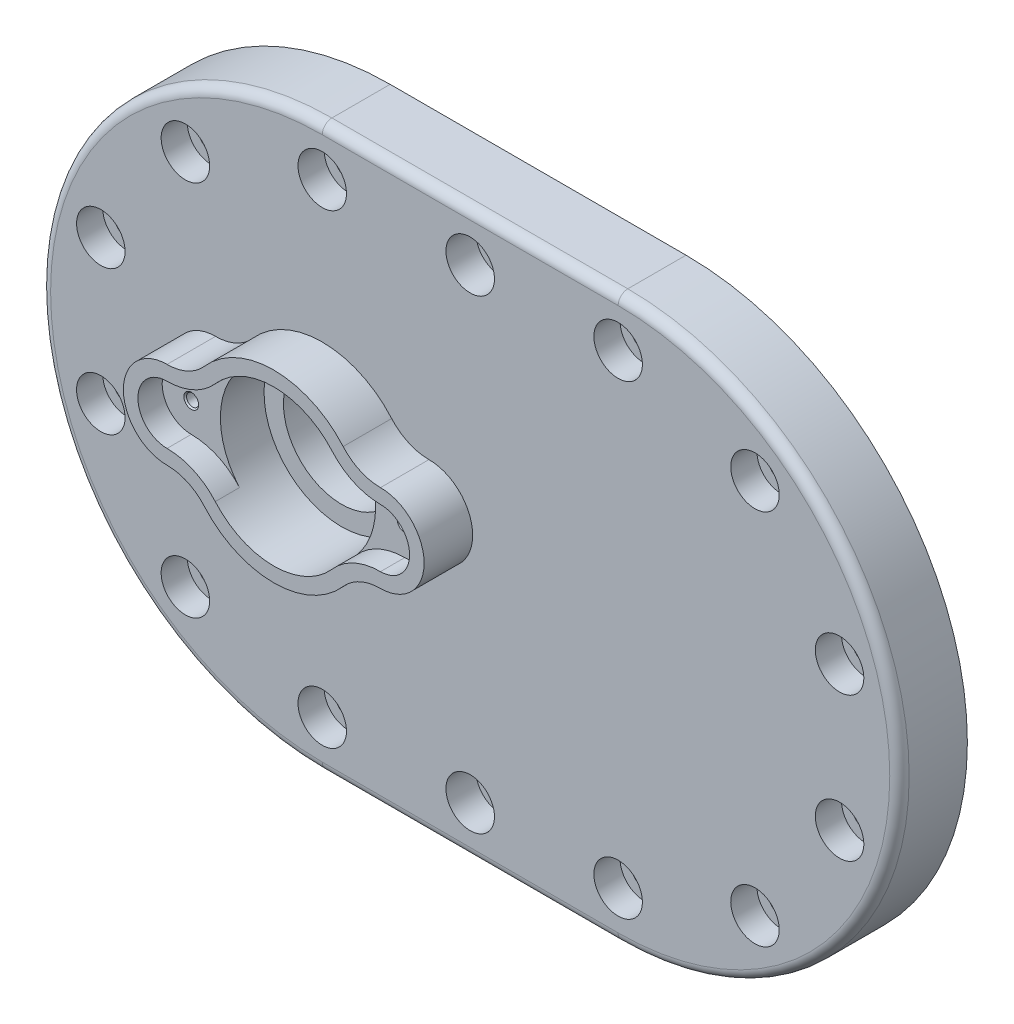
ISO-10303-21;
HEADER;
FILE_DESCRIPTION(('STEP AP214'),'2;1');
FILE_NAME('part.step','',(''),(''),'','','');
FILE_SCHEMA(('AUTOMOTIVE_DESIGN { 1 0 10303 214 1 1 1 1 }'));
ENDSEC;
DATA;
#1=APPLICATION_CONTEXT('core data for automotive mechanical design processes');
#2=APPLICATION_PROTOCOL_DEFINITION('international standard','automotive_design',2000,#1);
#3=PRODUCT_CONTEXT('',#1,'mechanical');
#4=PRODUCT('Part','Part','',(#3));
#5=PRODUCT_RELATED_PRODUCT_CATEGORY('part','',(#4));
#6=PRODUCT_DEFINITION_FORMATION('','',#4);
#7=PRODUCT_DEFINITION_CONTEXT('part definition',#1,'design');
#8=PRODUCT_DEFINITION('design','',#6,#7);
#9=PRODUCT_DEFINITION_SHAPE('','',#8);
#10=(LENGTH_UNIT() NAMED_UNIT(*) SI_UNIT(.MILLI.,.METRE.));
#11=(NAMED_UNIT(*) PLANE_ANGLE_UNIT() SI_UNIT($,.RADIAN.));
#12=(NAMED_UNIT(*) SI_UNIT($,.STERADIAN.) SOLID_ANGLE_UNIT());
#13=UNCERTAINTY_MEASURE_WITH_UNIT(LENGTH_MEASURE(1.E-05),#10,'distance_accuracy_value','');
#14=(GEOMETRIC_REPRESENTATION_CONTEXT(3) GLOBAL_UNCERTAINTY_ASSIGNED_CONTEXT((#13)) GLOBAL_UNIT_ASSIGNED_CONTEXT((#10,
#11,#12)) REPRESENTATION_CONTEXT('',''));
#15=CARTESIAN_POINT('',(0.,0.,0.));
#16=DIRECTION('',(0.,0.,1.));
#17=DIRECTION('',(1.,0.,0.));
#18=AXIS2_PLACEMENT_3D('',#15,#16,#17);
#19=CARTESIAN_POINT('',(-30.5,0.,14.));
#20=DIRECTION('',(0.,0.,-1.));
#21=DIRECTION('',(-1.,0.,0.));
#22=AXIS2_PLACEMENT_3D('',#19,#20,#21);
#23=CYLINDRICAL_SURFACE('',#22,58.);
#24=DIRECTION('',(0.,0.,-1.));
#25=VECTOR('',#24,1.);
#26=CARTESIAN_POINT('',(-30.5,-58.,14.));
#27=LINE('',#26,#25);
#28=CARTESIAN_POINT('',(-30.5,-58.,12.));
#29=VERTEX_POINT('',#28);
#30=CARTESIAN_POINT('',(-30.5,-58.,0.));
#31=VERTEX_POINT('',#30);
#32=EDGE_CURVE('E669',#29,#31,#27,.T.);
#33=ORIENTED_EDGE('',*,*,#32,.F.);
#34=CARTESIAN_POINT('',(-30.5,0.,12.));
#35=DIRECTION('',(0.,0.,1.));
#36=DIRECTION('',(1.,0.,0.));
#37=AXIS2_PLACEMENT_3D('',#34,#35,#36);
#38=CIRCLE('',#37,58.);
#39=CARTESIAN_POINT('',(-30.5,58.,12.));
#40=VERTEX_POINT('',#39);
#41=EDGE_CURVE('E70',#29,#40,#38,.F.);
#42=ORIENTED_EDGE('',*,*,#41,.T.);
#43=DIRECTION('',(0.,0.,-1.));
#44=VECTOR('',#43,1.);
#45=CARTESIAN_POINT('',(-30.5,58.,14.));
#46=LINE('',#45,#44);
#47=CARTESIAN_POINT('',(-30.5,58.,0.));
#48=VERTEX_POINT('',#47);
#49=EDGE_CURVE('E660',#40,#48,#46,.T.);
#50=ORIENTED_EDGE('',*,*,#49,.T.);
#51=CARTESIAN_POINT('',(-30.5,0.,0.));
#52=DIRECTION('',(0.,0.,1.));
#53=DIRECTION('',(1.,0.,0.));
#54=AXIS2_PLACEMENT_3D('',#51,#52,#53);
#55=CIRCLE('',#54,58.);
#56=EDGE_CURVE('E616',#48,#31,#55,.T.);
#57=ORIENTED_EDGE('',*,*,#56,.T.);
#58=EDGE_LOOP('',(#33,#42,#50,#57));
#59=FACE_BOUND('',#58,.T.);
#60=ADVANCED_FACE('F45',(#59),#23,.T.);
#61=CARTESIAN_POINT('',(-30.5,-58.,14.));
#62=DIRECTION('',(0.,1.,0.));
#63=DIRECTION('',(-1.,0.,0.));
#64=AXIS2_PLACEMENT_3D('',#61,#62,#63);
#65=PLANE('',#64);
#66=DIRECTION('',(0.,0.,-1.));
#67=VECTOR('',#66,1.);
#68=CARTESIAN_POINT('',(30.5,-58.,14.));
#69=LINE('',#68,#67);
#70=CARTESIAN_POINT('',(30.5,-58.,12.));
#71=VERTEX_POINT('',#70);
#72=CARTESIAN_POINT('',(30.5,-58.,0.));
#73=VERTEX_POINT('',#72);
#74=EDGE_CURVE('E666',#71,#73,#69,.T.);
#75=ORIENTED_EDGE('',*,*,#74,.F.);
#76=DIRECTION('',(1.,0.,0.));
#77=VECTOR('',#76,1.);
#78=CARTESIAN_POINT('',(-30.5,-58.,12.));
#79=LINE('',#78,#77);
#80=EDGE_CURVE('E693',#71,#29,#79,.F.);
#81=ORIENTED_EDGE('',*,*,#80,.T.);
#82=ORIENTED_EDGE('',*,*,#32,.T.);
#83=DIRECTION('',(1.,0.,0.));
#84=VECTOR('',#83,1.);
#85=CARTESIAN_POINT('',(-30.5,-58.,0.));
#86=LINE('',#85,#84);
#87=EDGE_CURVE('E648',#31,#73,#86,.T.);
#88=ORIENTED_EDGE('',*,*,#87,.T.);
#89=EDGE_LOOP('',(#75,#81,#82,#88));
#90=FACE_BOUND('',#89,.T.);
#91=ADVANCED_FACE('F774',(#90),#65,.F.);
#92=CARTESIAN_POINT('',(30.5,0.,14.));
#93=DIRECTION('',(0.,0.,-1.));
#94=DIRECTION('',(-1.,0.,0.));
#95=AXIS2_PLACEMENT_3D('',#92,#93,#94);
#96=CYLINDRICAL_SURFACE('',#95,58.);
#97=DIRECTION('',(0.,0.,-1.));
#98=VECTOR('',#97,1.);
#99=CARTESIAN_POINT('',(30.5,58.,14.));
#100=LINE('',#99,#98);
#101=CARTESIAN_POINT('',(30.5,58.,12.));
#102=VERTEX_POINT('',#101);
#103=CARTESIAN_POINT('',(30.5,58.,0.));
#104=VERTEX_POINT('',#103);
#105=EDGE_CURVE('E663',#102,#104,#100,.T.);
#106=ORIENTED_EDGE('',*,*,#105,.F.);
#107=CARTESIAN_POINT('',(30.5,0.,12.));
#108=DIRECTION('',(0.,0.,1.));
#109=DIRECTION('',(1.,0.,0.));
#110=AXIS2_PLACEMENT_3D('',#107,#108,#109);
#111=CIRCLE('',#110,58.);
#112=EDGE_CURVE('E11',#102,#71,#111,.F.);
#113=ORIENTED_EDGE('',*,*,#112,.T.);
#114=ORIENTED_EDGE('',*,*,#74,.T.);
#115=CARTESIAN_POINT('',(30.5,0.,0.));
#116=DIRECTION('',(0.,0.,1.));
#117=DIRECTION('',(1.,0.,0.));
#118=AXIS2_PLACEMENT_3D('',#115,#116,#117);
#119=CIRCLE('',#118,58.);
#120=EDGE_CURVE('E652',#73,#104,#119,.T.);
#121=ORIENTED_EDGE('',*,*,#120,.T.);
#122=EDGE_LOOP('',(#106,#113,#114,#121));
#123=FACE_BOUND('',#122,.T.);
#124=ADVANCED_FACE('F779',(#123),#96,.T.);
#125=CARTESIAN_POINT('',(-30.5,58.,14.));
#126=DIRECTION('',(0.,1.,0.));
#127=DIRECTION('',(-1.,0.,0.));
#128=AXIS2_PLACEMENT_3D('',#125,#126,#127);
#129=PLANE('',#128);
#130=ORIENTED_EDGE('',*,*,#49,.F.);
#131=DIRECTION('',(1.,0.,0.));
#132=VECTOR('',#131,1.);
#133=CARTESIAN_POINT('',(-30.5,58.,12.));
#134=LINE('',#133,#132);
#135=EDGE_CURVE('E55',#40,#102,#134,.T.);
#136=ORIENTED_EDGE('',*,*,#135,.T.);
#137=ORIENTED_EDGE('',*,*,#105,.T.);
#138=DIRECTION('',(1.,0.,0.));
#139=VECTOR('',#138,1.);
#140=CARTESIAN_POINT('',(-30.5,58.,0.));
#141=LINE('',#140,#139);
#142=EDGE_CURVE('E656',#48,#104,#141,.T.);
#143=ORIENTED_EDGE('',*,*,#142,.F.);
#144=EDGE_LOOP('',(#130,#136,#137,#143));
#145=FACE_BOUND('',#144,.T.);
#146=ADVANCED_FACE('F824',(#145),#129,.T.);
#147=CARTESIAN_POINT('',(-30.5,0.,14.));
#148=DIRECTION('',(0.,0.,1.));
#149=DIRECTION('',(1.,0.,0.));
#150=AXIS2_PLACEMENT_3D('',#147,#148,#149);
#151=PLANE('',#150);
#152=CARTESIAN_POINT('',(-30.5,0.,14.));
#153=DIRECTION('',(0.,0.,1.));
#154=DIRECTION('',(1.,0.,0.));
#155=AXIS2_PLACEMENT_3D('',#152,#153,#154);
#156=CIRCLE('',#155,56.);
#157=CARTESIAN_POINT('',(-30.5,56.,14.));
#158=VERTEX_POINT('',#157);
#159=CARTESIAN_POINT('',(-30.5,-56.,14.));
#160=VERTEX_POINT('',#159);
#161=EDGE_CURVE('E686',#158,#160,#156,.T.);
#162=ORIENTED_EDGE('',*,*,#161,.T.);
#163=DIRECTION('',(1.,0.,0.));
#164=VECTOR('',#163,1.);
#165=CARTESIAN_POINT('',(30.5,-56.,14.));
#166=LINE('',#165,#164);
#167=CARTESIAN_POINT('',(30.5,-56.,14.));
#168=VERTEX_POINT('',#167);
#169=EDGE_CURVE('E689',#160,#168,#166,.T.);
#170=ORIENTED_EDGE('',*,*,#169,.T.);
#171=CARTESIAN_POINT('',(30.5,0.,14.));
#172=DIRECTION('',(0.,0.,1.));
#173=DIRECTION('',(1.,0.,0.));
#174=AXIS2_PLACEMENT_3D('',#171,#172,#173);
#175=CIRCLE('',#174,56.);
#176=CARTESIAN_POINT('',(30.5,56.,14.));
#177=VERTEX_POINT('',#176);
#178=EDGE_CURVE('E680',#168,#177,#175,.T.);
#179=ORIENTED_EDGE('',*,*,#178,.T.);
#180=DIRECTION('',(1.,0.,0.));
#181=VECTOR('',#180,1.);
#182=CARTESIAN_POINT('',(-30.5,56.,14.));
#183=LINE('',#182,#181);
#184=EDGE_CURVE('E683',#177,#158,#183,.F.);
#185=ORIENTED_EDGE('',*,*,#184,.T.);
#186=EDGE_LOOP('',(#162,#170,#179,#185));
#187=FACE_BOUND('',#186,.T.);
#188=CARTESIAN_POINT('',(0.,48.,14.));
#189=DIRECTION('',(0.,0.,1.));
#190=DIRECTION('',(1.,0.,0.));
#191=AXIS2_PLACEMENT_3D('',#188,#189,#190);
#192=CIRCLE('',#191,4.99999999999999);
#193=CARTESIAN_POINT('',(4.99999999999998,48.,14.));
#194=VERTEX_POINT('',#193);
#195=EDGE_CURVE('E235',#194,#194,#192,.T.);
#196=ORIENTED_EDGE('',*,*,#195,.F.);
#197=EDGE_LOOP('',(#196));
#198=FACE_BOUND('',#197,.T.);
#199=CARTESIAN_POINT('',(0.,-48.,14.));
#200=DIRECTION('',(0.,0.,1.));
#201=DIRECTION('',(1.,0.,0.));
#202=AXIS2_PLACEMENT_3D('',#199,#200,#201);
#203=CIRCLE('',#202,4.99999999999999);
#204=CARTESIAN_POINT('',(5.,-48.,14.));
#205=VERTEX_POINT('',#204);
#206=EDGE_CURVE('E251',#205,#205,#203,.T.);
#207=ORIENTED_EDGE('',*,*,#206,.F.);
#208=EDGE_LOOP('',(#207));
#209=FACE_BOUND('',#208,.T.);
#210=CARTESIAN_POINT('',(-30.5,-48.,14.));
#211=DIRECTION('',(0.,0.,-1.));
#212=DIRECTION('',(1.,0.,0.));
#213=AXIS2_PLACEMENT_3D('',#210,#211,#212);
#214=CIRCLE('',#213,5.);
#215=CARTESIAN_POINT('',(-25.5,-48.,14.));
#216=VERTEX_POINT('',#215);
#217=EDGE_CURVE('E267',#216,#216,#214,.T.);
#218=ORIENTED_EDGE('',*,*,#217,.T.);
#219=EDGE_LOOP('',(#218));
#220=FACE_BOUND('',#219,.T.);
#221=CARTESIAN_POINT('',(-58.7136921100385,-38.8328157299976,14.));
#222=DIRECTION('',(0.,0.,-1.));
#223=DIRECTION('',(0.809016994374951,-0.587785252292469,0.));
#224=AXIS2_PLACEMENT_3D('',#221,#222,#223);
#225=CIRCLE('',#224,5.);
#226=CARTESIAN_POINT('',(-54.6686071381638,-41.77174199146,14.));
#227=VERTEX_POINT('',#226);
#228=EDGE_CURVE('E318',#227,#227,#225,.T.);
#229=ORIENTED_EDGE('',*,*,#228,.T.);
#230=EDGE_LOOP('',(#229));
#231=FACE_BOUND('',#230,.T.);
#232=CARTESIAN_POINT('',(-76.1507127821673,-14.8328157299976,14.));
#233=DIRECTION('',(0.,0.,-1.));
#234=DIRECTION('',(0.309016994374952,-0.951056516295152,0.));
#235=AXIS2_PLACEMENT_3D('',#232,#233,#234);
#236=CIRCLE('',#235,5.);
#237=CARTESIAN_POINT('',(-74.6056278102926,-19.5880983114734,14.));
#238=VERTEX_POINT('',#237);
#239=EDGE_CURVE('E302',#238,#238,#236,.T.);
#240=ORIENTED_EDGE('',*,*,#239,.T.);
#241=EDGE_LOOP('',(#240));
#242=FACE_BOUND('',#241,.T.);
#243=CARTESIAN_POINT('',(-76.1507127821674,14.8328157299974,14.));
#244=DIRECTION('',(0.,0.,-1.));
#245=DIRECTION('',(-0.309016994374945,-0.951056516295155,0.));
#246=AXIS2_PLACEMENT_3D('',#243,#244,#245);
#247=CIRCLE('',#246,5.);
#248=CARTESIAN_POINT('',(-77.6957977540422,10.0775331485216,14.));
#249=VERTEX_POINT('',#248);
#250=EDGE_CURVE('E286',#249,#249,#247,.T.);
#251=ORIENTED_EDGE('',*,*,#250,.T.);
#252=EDGE_LOOP('',(#251));
#253=FACE_BOUND('',#252,.T.);
#254=CARTESIAN_POINT('',(-58.7136921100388,38.8328157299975,14.));
#255=DIRECTION('',(0.,0.,-1.));
#256=DIRECTION('',(-0.809016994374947,-0.587785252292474,0.));
#257=AXIS2_PLACEMENT_3D('',#254,#255,#256);
#258=CIRCLE('',#257,5.);
#259=CARTESIAN_POINT('',(-62.7587770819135,35.8938894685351,14.));
#260=VERTEX_POINT('',#259);
#261=EDGE_CURVE('E268',#260,#260,#258,.T.);
#262=ORIENTED_EDGE('',*,*,#261,.T.);
#263=EDGE_LOOP('',(#262));
#264=FACE_BOUND('',#263,.T.);
#265=CARTESIAN_POINT('',(-30.5,48.,14.));
#266=DIRECTION('',(0.,0.,-1.));
#267=DIRECTION('',(-1.,0.,0.));
#268=AXIS2_PLACEMENT_3D('',#265,#266,#267);
#269=CIRCLE('',#268,5.);
#270=CARTESIAN_POINT('',(-35.5,48.,14.));
#271=VERTEX_POINT('',#270);
#272=EDGE_CURVE('E285',#271,#271,#269,.T.);
#273=ORIENTED_EDGE('',*,*,#272,.T.);
#274=EDGE_LOOP('',(#273));
#275=FACE_BOUND('',#274,.T.);
#276=CARTESIAN_POINT('',(58.7136921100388,38.8328157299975,14.));
#277=DIRECTION('',(0.,0.,1.));
#278=DIRECTION('',(0.809016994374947,-0.587785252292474,0.));
#279=AXIS2_PLACEMENT_3D('',#276,#277,#278);
#280=CIRCLE('',#279,5.);
#281=CARTESIAN_POINT('',(62.7587770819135,35.8938894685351,14.));
#282=VERTEX_POINT('',#281);
#283=EDGE_CURVE('E364',#282,#282,#280,.T.);
#284=ORIENTED_EDGE('',*,*,#283,.F.);
#285=EDGE_LOOP('',(#284));
#286=FACE_BOUND('',#285,.T.);
#287=CARTESIAN_POINT('',(76.1507127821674,14.8328157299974,14.));
#288=DIRECTION('',(0.,0.,1.));
#289=DIRECTION('',(0.309016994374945,-0.951056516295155,0.));
#290=AXIS2_PLACEMENT_3D('',#287,#288,#289);
#291=CIRCLE('',#290,5.);
#292=CARTESIAN_POINT('',(77.6957977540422,10.0775331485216,14.));
#293=VERTEX_POINT('',#292);
#294=EDGE_CURVE('E382',#293,#293,#291,.T.);
#295=ORIENTED_EDGE('',*,*,#294,.F.);
#296=EDGE_LOOP('',(#295));
#297=FACE_BOUND('',#296,.T.);
#298=CARTESIAN_POINT('',(76.1507127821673,-14.8328157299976,14.));
#299=DIRECTION('',(0.,0.,1.));
#300=DIRECTION('',(-0.309016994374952,-0.951056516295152,0.));
#301=AXIS2_PLACEMENT_3D('',#298,#299,#300);
#302=CIRCLE('',#301,5.);
#303=CARTESIAN_POINT('',(74.6056278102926,-19.5880983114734,14.));
#304=VERTEX_POINT('',#303);
#305=EDGE_CURVE('E398',#304,#304,#302,.T.);
#306=ORIENTED_EDGE('',*,*,#305,.F.);
#307=EDGE_LOOP('',(#306));
#308=FACE_BOUND('',#307,.T.);
#309=CARTESIAN_POINT('',(58.7136921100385,-38.8328157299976,14.));
#310=DIRECTION('',(0.,0.,1.));
#311=DIRECTION('',(-0.809016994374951,-0.587785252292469,0.));
#312=AXIS2_PLACEMENT_3D('',#309,#310,#311);
#313=CIRCLE('',#312,5.);
#314=CARTESIAN_POINT('',(54.6686071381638,-41.77174199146,14.));
#315=VERTEX_POINT('',#314);
#316=EDGE_CURVE('E414',#315,#315,#313,.T.);
#317=ORIENTED_EDGE('',*,*,#316,.F.);
#318=EDGE_LOOP('',(#317));
#319=FACE_BOUND('',#318,.T.);
#320=CARTESIAN_POINT('',(30.5,-48.,14.));
#321=DIRECTION('',(0.,0.,1.));
#322=DIRECTION('',(-1.,0.,0.));
#323=AXIS2_PLACEMENT_3D('',#320,#321,#322);
#324=CIRCLE('',#323,5.);
#325=CARTESIAN_POINT('',(25.5,-48.,14.));
#326=VERTEX_POINT('',#325);
#327=EDGE_CURVE('E363',#326,#326,#324,.T.);
#328=ORIENTED_EDGE('',*,*,#327,.F.);
#329=EDGE_LOOP('',(#328));
#330=FACE_BOUND('',#329,.T.);
#331=CARTESIAN_POINT('',(30.5,48.,14.));
#332=DIRECTION('',(0.,0.,1.));
#333=DIRECTION('',(1.,0.,0.));
#334=AXIS2_PLACEMENT_3D('',#331,#332,#333);
#335=CIRCLE('',#334,5.);
#336=CARTESIAN_POINT('',(35.5,48.,14.));
#337=VERTEX_POINT('',#336);
#338=EDGE_CURVE('E381',#337,#337,#335,.T.);
#339=ORIENTED_EDGE('',*,*,#338,.F.);
#340=EDGE_LOOP('',(#339));
#341=FACE_BOUND('',#340,.T.);
#342=CARTESIAN_POINT('',(-30.5,0.,14.));
#343=DIRECTION('',(0.,0.,1.));
#344=DIRECTION('',(1.,0.,0.));
#345=AXIS2_PLACEMENT_3D('',#342,#343,#344);
#346=CIRCLE('',#345,19.);
#347=CARTESIAN_POINT('',(-16.1849315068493,12.4931506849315,14.));
#348=VERTEX_POINT('',#347);
#349=CARTESIAN_POINT('',(-44.8150684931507,12.4931506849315,14.));
#350=VERTEX_POINT('',#349);
#351=EDGE_CURVE('E563',#348,#350,#346,.T.);
#352=ORIENTED_EDGE('',*,*,#351,.F.);
#353=CARTESIAN_POINT('',(-8.50000000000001,19.2,14.));
#354=DIRECTION('',(0.,0.,1.));
#355=DIRECTION('',(1.,0.,0.));
#356=AXIS2_PLACEMENT_3D('',#353,#354,#355);
#357=CIRCLE('',#356,10.2);
#358=CARTESIAN_POINT('',(-8.5,9.,14.));
#359=VERTEX_POINT('',#358);
#360=EDGE_CURVE('E500',#359,#348,#357,.F.);
#361=ORIENTED_EDGE('',*,*,#360,.F.);
#362=CARTESIAN_POINT('',(-8.5,0.,14.));
#363=DIRECTION('',(0.,0.,1.));
#364=DIRECTION('',(1.,0.,0.));
#365=AXIS2_PLACEMENT_3D('',#362,#363,#364);
#366=CIRCLE('',#365,9.);
#367=CARTESIAN_POINT('',(-8.5,-9.,14.));
#368=VERTEX_POINT('',#367);
#369=EDGE_CURVE('E506',#368,#359,#366,.T.);
#370=ORIENTED_EDGE('',*,*,#369,.F.);
#371=CARTESIAN_POINT('',(-8.50000000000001,-19.2,14.));
#372=DIRECTION('',(0.,0.,1.));
#373=DIRECTION('',(1.,0.,0.));
#374=AXIS2_PLACEMENT_3D('',#371,#372,#373);
#375=CIRCLE('',#374,10.2);
#376=CARTESIAN_POINT('',(-16.1849315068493,-12.4931506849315,14.));
#377=VERTEX_POINT('',#376);
#378=EDGE_CURVE('E582',#368,#377,#375,.T.);
#379=ORIENTED_EDGE('',*,*,#378,.T.);
#380=CARTESIAN_POINT('',(-30.5,0.,14.));
#381=DIRECTION('',(0.,0.,1.));
#382=DIRECTION('',(1.,0.,0.));
#383=AXIS2_PLACEMENT_3D('',#380,#381,#382);
#384=CIRCLE('',#383,19.);
#385=CARTESIAN_POINT('',(-44.8150684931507,-12.4931506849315,14.));
#386=VERTEX_POINT('',#385);
#387=EDGE_CURVE('E578',#386,#377,#384,.T.);
#388=ORIENTED_EDGE('',*,*,#387,.F.);
#389=CARTESIAN_POINT('',(-52.5,-19.2,14.));
#390=DIRECTION('',(0.,0.,1.));
#391=DIRECTION('',(1.,0.,0.));
#392=AXIS2_PLACEMENT_3D('',#389,#390,#391);
#393=CIRCLE('',#392,10.2);
#394=CARTESIAN_POINT('',(-52.5,-8.99999999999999,14.));
#395=VERTEX_POINT('',#394);
#396=EDGE_CURVE('E575',#395,#386,#393,.F.);
#397=ORIENTED_EDGE('',*,*,#396,.F.);
#398=CARTESIAN_POINT('',(-52.5,0.,14.));
#399=DIRECTION('',(0.,0.,1.));
#400=DIRECTION('',(1.,0.,0.));
#401=AXIS2_PLACEMENT_3D('',#398,#399,#400);
#402=CIRCLE('',#401,8.99999999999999);
#403=CARTESIAN_POINT('',(-52.5,9.,14.));
#404=VERTEX_POINT('',#403);
#405=EDGE_CURVE('E571',#395,#404,#402,.F.);
#406=ORIENTED_EDGE('',*,*,#405,.T.);
#407=CARTESIAN_POINT('',(-52.5,19.2,14.));
#408=DIRECTION('',(0.,0.,1.));
#409=DIRECTION('',(1.,0.,0.));
#410=AXIS2_PLACEMENT_3D('',#407,#408,#409);
#411=CIRCLE('',#410,10.2);
#412=EDGE_CURVE('E567',#404,#350,#411,.T.);
#413=ORIENTED_EDGE('',*,*,#412,.T.);
#414=EDGE_LOOP('',(#352,#361,#370,#379,#388,#397,#406,#413));
#415=FACE_BOUND('',#414,.T.);
#416=ADVANCED_FACE('F820',(#187,#198,#209,#220,#231,#242,#253,#264,#275,#286,#297,#308,#319,
#330,#341,#415),#151,.T.);
#417=CARTESIAN_POINT('',(-30.5,0.,0.));
#418=DIRECTION('',(0.,0.,1.));
#419=DIRECTION('',(1.,0.,0.));
#420=AXIS2_PLACEMENT_3D('',#417,#418,#419);
#421=PLANE('',#420);
#422=CARTESIAN_POINT('',(30.5,0.,0.));
#423=DIRECTION('',(0.,0.,1.));
#424=DIRECTION('',(1.,0.,0.));
#425=AXIS2_PLACEMENT_3D('',#422,#423,#424);
#426=CIRCLE('',#425,13.);
#427=CARTESIAN_POINT('',(43.5,0.,0.));
#428=VERTEX_POINT('',#427);
#429=EDGE_CURVE('E676',#428,#428,#426,.T.);
#430=ORIENTED_EDGE('',*,*,#429,.T.);
#431=EDGE_LOOP('',(#430));
#432=FACE_BOUND('',#431,.T.);
#433=CARTESIAN_POINT('',(0.,48.,0.));
#434=DIRECTION('',(0.,0.,1.));
#435=DIRECTION('',(1.,0.,0.));
#436=AXIS2_PLACEMENT_3D('',#433,#434,#435);
#437=CIRCLE('',#436,2.75);
#438=CARTESIAN_POINT('',(2.74999999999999,48.,0.));
#439=VERTEX_POINT('',#438);
#440=EDGE_CURVE('E247',#439,#439,#437,.T.);
#441=ORIENTED_EDGE('',*,*,#440,.T.);
#442=EDGE_LOOP('',(#441));
#443=FACE_BOUND('',#442,.T.);
#444=CARTESIAN_POINT('',(0.,-48.,0.));
#445=DIRECTION('',(0.,0.,1.));
#446=DIRECTION('',(1.,0.,0.));
#447=AXIS2_PLACEMENT_3D('',#444,#445,#446);
#448=CIRCLE('',#447,2.75);
#449=CARTESIAN_POINT('',(2.75000000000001,-48.,0.));
#450=VERTEX_POINT('',#449);
#451=EDGE_CURVE('E263',#450,#450,#448,.T.);
#452=ORIENTED_EDGE('',*,*,#451,.T.);
#453=EDGE_LOOP('',(#452));
#454=FACE_BOUND('',#453,.T.);
#455=CARTESIAN_POINT('',(-30.5,-48.,0.));
#456=DIRECTION('',(0.,0.,-1.));
#457=DIRECTION('',(1.,0.,0.));
#458=AXIS2_PLACEMENT_3D('',#455,#456,#457);
#459=CIRCLE('',#458,2.75);
#460=CARTESIAN_POINT('',(-27.75,-48.,0.));
#461=VERTEX_POINT('',#460);
#462=EDGE_CURVE('E337',#461,#461,#459,.T.);
#463=ORIENTED_EDGE('',*,*,#462,.F.);
#464=EDGE_LOOP('',(#463));
#465=FACE_BOUND('',#464,.T.);
#466=CARTESIAN_POINT('',(-58.7136921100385,-38.8328157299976,0.));
#467=DIRECTION('',(0.,0.,-1.));
#468=DIRECTION('',(0.809016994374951,-0.587785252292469,0.));
#469=AXIS2_PLACEMENT_3D('',#466,#467,#468);
#470=CIRCLE('',#469,2.75);
#471=CARTESIAN_POINT('',(-56.4888953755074,-40.4492251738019,0.));
#472=VERTEX_POINT('',#471);
#473=EDGE_CURVE('E322',#472,#472,#470,.T.);
#474=ORIENTED_EDGE('',*,*,#473,.F.);
#475=EDGE_LOOP('',(#474));
#476=FACE_BOUND('',#475,.T.);
#477=CARTESIAN_POINT('',(-76.1507127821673,-14.8328157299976,0.));
#478=DIRECTION('',(0.,0.,-1.));
#479=DIRECTION('',(0.309016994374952,-0.951056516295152,0.));
#480=AXIS2_PLACEMENT_3D('',#477,#478,#479);
#481=CIRCLE('',#480,2.75);
#482=CARTESIAN_POINT('',(-75.3009160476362,-17.4482211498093,0.));
#483=VERTEX_POINT('',#482);
#484=EDGE_CURVE('E306',#483,#483,#481,.T.);
#485=ORIENTED_EDGE('',*,*,#484,.F.);
#486=EDGE_LOOP('',(#485));
#487=FACE_BOUND('',#486,.T.);
#488=CARTESIAN_POINT('',(-76.1507127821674,14.8328157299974,0.));
#489=DIRECTION('',(0.,0.,-1.));
#490=DIRECTION('',(-0.309016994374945,-0.951056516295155,0.));
#491=AXIS2_PLACEMENT_3D('',#488,#489,#490);
#492=CIRCLE('',#491,2.75);
#493=CARTESIAN_POINT('',(-77.0005095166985,12.2174103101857,0.));
#494=VERTEX_POINT('',#493);
#495=EDGE_CURVE('E290',#494,#494,#492,.T.);
#496=ORIENTED_EDGE('',*,*,#495,.F.);
#497=EDGE_LOOP('',(#496));
#498=FACE_BOUND('',#497,.T.);
#499=CARTESIAN_POINT('',(-58.7136921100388,38.8328157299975,0.));
#500=DIRECTION('',(0.,0.,-1.));
#501=DIRECTION('',(-0.809016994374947,-0.587785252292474,0.));
#502=AXIS2_PLACEMENT_3D('',#499,#500,#501);
#503=CIRCLE('',#502,2.75);
#504=CARTESIAN_POINT('',(-60.9384888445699,37.2164062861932,0.));
#505=VERTEX_POINT('',#504);
#506=EDGE_CURVE('E272',#505,#505,#503,.T.);
#507=ORIENTED_EDGE('',*,*,#506,.F.);
#508=EDGE_LOOP('',(#507));
#509=FACE_BOUND('',#508,.T.);
#510=CARTESIAN_POINT('',(-30.5,48.,0.));
#511=DIRECTION('',(0.,0.,-1.));
#512=DIRECTION('',(-1.,0.,0.));
#513=AXIS2_PLACEMENT_3D('',#510,#511,#512);
#514=CIRCLE('',#513,2.75);
#515=CARTESIAN_POINT('',(-33.25,48.,0.));
#516=VERTEX_POINT('',#515);
#517=EDGE_CURVE('E351',#516,#516,#514,.T.);
#518=ORIENTED_EDGE('',*,*,#517,.F.);
#519=EDGE_LOOP('',(#518));
#520=FACE_BOUND('',#519,.T.);
#521=CARTESIAN_POINT('',(58.7136921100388,38.8328157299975,0.));
#522=DIRECTION('',(0.,0.,1.));
#523=DIRECTION('',(0.809016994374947,-0.587785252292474,0.));
#524=AXIS2_PLACEMENT_3D('',#521,#522,#523);
#525=CIRCLE('',#524,2.75);
#526=CARTESIAN_POINT('',(60.9384888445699,37.2164062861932,0.));
#527=VERTEX_POINT('',#526);
#528=EDGE_CURVE('E368',#527,#527,#525,.T.);
#529=ORIENTED_EDGE('',*,*,#528,.T.);
#530=EDGE_LOOP('',(#529));
#531=FACE_BOUND('',#530,.T.);
#532=CARTESIAN_POINT('',(76.1507127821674,14.8328157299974,0.));
#533=DIRECTION('',(0.,0.,1.));
#534=DIRECTION('',(0.309016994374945,-0.951056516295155,0.));
#535=AXIS2_PLACEMENT_3D('',#532,#533,#534);
#536=CIRCLE('',#535,2.75);
#537=CARTESIAN_POINT('',(77.0005095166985,12.2174103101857,0.));
#538=VERTEX_POINT('',#537);
#539=EDGE_CURVE('E386',#538,#538,#536,.T.);
#540=ORIENTED_EDGE('',*,*,#539,.T.);
#541=EDGE_LOOP('',(#540));
#542=FACE_BOUND('',#541,.T.);
#543=CARTESIAN_POINT('',(76.1507127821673,-14.8328157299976,0.));
#544=DIRECTION('',(0.,0.,1.));
#545=DIRECTION('',(-0.309016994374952,-0.951056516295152,0.));
#546=AXIS2_PLACEMENT_3D('',#543,#544,#545);
#547=CIRCLE('',#546,2.75);
#548=CARTESIAN_POINT('',(75.3009160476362,-17.4482211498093,0.));
#549=VERTEX_POINT('',#548);
#550=EDGE_CURVE('E402',#549,#549,#547,.T.);
#551=ORIENTED_EDGE('',*,*,#550,.T.);
#552=EDGE_LOOP('',(#551));
#553=FACE_BOUND('',#552,.T.);
#554=CARTESIAN_POINT('',(58.7136921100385,-38.8328157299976,0.));
#555=DIRECTION('',(0.,0.,1.));
#556=DIRECTION('',(-0.809016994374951,-0.587785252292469,0.));
#557=AXIS2_PLACEMENT_3D('',#554,#555,#556);
#558=CIRCLE('',#557,2.75);
#559=CARTESIAN_POINT('',(56.4888953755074,-40.4492251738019,0.));
#560=VERTEX_POINT('',#559);
#561=EDGE_CURVE('E418',#560,#560,#558,.T.);
#562=ORIENTED_EDGE('',*,*,#561,.T.);
#563=EDGE_LOOP('',(#562));
#564=FACE_BOUND('',#563,.T.);
#565=CARTESIAN_POINT('',(30.5,-48.,0.));
#566=DIRECTION('',(0.,0.,1.));
#567=DIRECTION('',(-1.,0.,0.));
#568=AXIS2_PLACEMENT_3D('',#565,#566,#567);
#569=CIRCLE('',#568,2.75);
#570=CARTESIAN_POINT('',(27.75,-48.,0.));
#571=VERTEX_POINT('',#570);
#572=EDGE_CURVE('E433',#571,#571,#569,.T.);
#573=ORIENTED_EDGE('',*,*,#572,.T.);
#574=EDGE_LOOP('',(#573));
#575=FACE_BOUND('',#574,.T.);
#576=CARTESIAN_POINT('',(30.5,48.,0.));
#577=DIRECTION('',(0.,0.,1.));
#578=DIRECTION('',(1.,0.,0.));
#579=AXIS2_PLACEMENT_3D('',#576,#577,#578);
#580=CIRCLE('',#579,2.75);
#581=CARTESIAN_POINT('',(33.25,48.,0.));
#582=VERTEX_POINT('',#581);
#583=EDGE_CURVE('E455',#582,#582,#580,.T.);
#584=ORIENTED_EDGE('',*,*,#583,.T.);
#585=EDGE_LOOP('',(#584));
#586=FACE_BOUND('',#585,.T.);
#587=CARTESIAN_POINT('',(-30.5,0.,0.));
#588=DIRECTION('',(0.,0.,1.));
#589=DIRECTION('',(1.,0.,0.));
#590=AXIS2_PLACEMENT_3D('',#587,#588,#589);
#591=CIRCLE('',#590,12.);
#592=CARTESIAN_POINT('',(-18.5,0.,0.));
#593=VERTEX_POINT('',#592);
#594=EDGE_CURVE('E463',#593,#593,#591,.F.);
#595=ORIENTED_EDGE('',*,*,#594,.F.);
#596=EDGE_LOOP('',(#595));
#597=FACE_BOUND('',#596,.T.);
#598=ORIENTED_EDGE('',*,*,#56,.F.);
#599=ORIENTED_EDGE('',*,*,#142,.T.);
#600=ORIENTED_EDGE('',*,*,#120,.F.);
#601=ORIENTED_EDGE('',*,*,#87,.F.);
#602=EDGE_LOOP('',(#598,#599,#600,#601));
#603=FACE_BOUND('',#602,.T.);
#604=ADVANCED_FACE('F823',(#432,#443,#454,#465,#476,#487,#498,#509,#520,#531,#542,#553,#564,
#575,#586,#597,#603),#421,.F.);
#605=CARTESIAN_POINT('',(-8.50000000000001,19.2,24.));
#606=DIRECTION('',(0.,0.,-1.));
#607=DIRECTION('',(-1.,0.,0.));
#608=AXIS2_PLACEMENT_3D('',#605,#606,#607);
#609=CYLINDRICAL_SURFACE('',#608,10.2);
#610=ORIENTED_EDGE('',*,*,#360,.T.);
#611=DIRECTION('',(0.,0.,-1.));
#612=VECTOR('',#611,1.);
#613=CARTESIAN_POINT('',(-16.1849315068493,12.4931506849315,24.));
#614=LINE('',#613,#612);
#615=CARTESIAN_POINT('',(-16.1849315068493,12.4931506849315,24.));
#616=VERTEX_POINT('',#615);
#617=EDGE_CURVE('E613',#616,#348,#614,.T.);
#618=ORIENTED_EDGE('',*,*,#617,.F.);
#619=CARTESIAN_POINT('',(-8.50000000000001,19.2,24.));
#620=DIRECTION('',(0.,0.,1.));
#621=DIRECTION('',(1.,0.,0.));
#622=AXIS2_PLACEMENT_3D('',#619,#620,#621);
#623=CIRCLE('',#622,10.2);
#624=CARTESIAN_POINT('',(-8.5,9.,24.));
#625=VERTEX_POINT('',#624);
#626=EDGE_CURVE('E531',#625,#616,#623,.F.);
#627=ORIENTED_EDGE('',*,*,#626,.F.);
#628=DIRECTION('',(0.,0.,-1.));
#629=VECTOR('',#628,1.);
#630=CARTESIAN_POINT('',(-8.5,9.,24.));
#631=LINE('',#630,#629);
#632=EDGE_CURVE('E588',#625,#359,#631,.T.);
#633=ORIENTED_EDGE('',*,*,#632,.T.);
#634=EDGE_LOOP('',(#610,#618,#627,#633));
#635=FACE_BOUND('',#634,.T.);
#636=ADVANCED_FACE('F864',(#635),#609,.F.);
#637=CARTESIAN_POINT('',(-30.5,0.,24.));
#638=DIRECTION('',(0.,0.,-1.));
#639=DIRECTION('',(-1.,0.,0.));
#640=AXIS2_PLACEMENT_3D('',#637,#638,#639);
#641=CYLINDRICAL_SURFACE('',#640,19.);
#642=ORIENTED_EDGE('',*,*,#351,.T.);
#643=DIRECTION('',(0.,0.,-1.));
#644=VECTOR('',#643,1.);
#645=CARTESIAN_POINT('',(-44.8150684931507,12.4931506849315,24.));
#646=LINE('',#645,#644);
#647=CARTESIAN_POINT('',(-44.8150684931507,12.4931506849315,24.));
#648=VERTEX_POINT('',#647);
#649=EDGE_CURVE('E610',#648,#350,#646,.T.);
#650=ORIENTED_EDGE('',*,*,#649,.F.);
#651=CARTESIAN_POINT('',(-30.5,0.,24.));
#652=DIRECTION('',(0.,0.,1.));
#653=DIRECTION('',(1.,0.,0.));
#654=AXIS2_PLACEMENT_3D('',#651,#652,#653);
#655=CIRCLE('',#654,19.);
#656=EDGE_CURVE('E535',#616,#648,#655,.T.);
#657=ORIENTED_EDGE('',*,*,#656,.F.);
#658=ORIENTED_EDGE('',*,*,#617,.T.);
#659=EDGE_LOOP('',(#642,#650,#657,#658));
#660=FACE_BOUND('',#659,.T.);
#661=ADVANCED_FACE('F860',(#660),#641,.T.);
#662=CARTESIAN_POINT('',(-52.5,19.2,24.));
#663=DIRECTION('',(0.,0.,-1.));
#664=DIRECTION('',(-1.,0.,0.));
#665=AXIS2_PLACEMENT_3D('',#662,#663,#664);
#666=CYLINDRICAL_SURFACE('',#665,10.2);
#667=ORIENTED_EDGE('',*,*,#412,.F.);
#668=DIRECTION('',(0.,0.,-1.));
#669=VECTOR('',#668,1.);
#670=CARTESIAN_POINT('',(-52.5,9.,24.));
#671=LINE('',#670,#669);
#672=CARTESIAN_POINT('',(-52.5,9.,24.));
#673=VERTEX_POINT('',#672);
#674=EDGE_CURVE('E607',#673,#404,#671,.T.);
#675=ORIENTED_EDGE('',*,*,#674,.F.);
#676=CARTESIAN_POINT('',(-52.5,19.2,24.));
#677=DIRECTION('',(0.,0.,1.));
#678=DIRECTION('',(1.,0.,0.));
#679=AXIS2_PLACEMENT_3D('',#676,#677,#678);
#680=CIRCLE('',#679,10.2);
#681=EDGE_CURVE('E538',#673,#648,#680,.T.);
#682=ORIENTED_EDGE('',*,*,#681,.T.);
#683=ORIENTED_EDGE('',*,*,#649,.T.);
#684=EDGE_LOOP('',(#667,#675,#682,#683));
#685=FACE_BOUND('',#684,.T.);
#686=ADVANCED_FACE('F888',(#685),#666,.F.);
#687=CARTESIAN_POINT('',(-52.5,0.,24.));
#688=DIRECTION('',(0.,0.,-1.));
#689=DIRECTION('',(-1.,0.,0.));
#690=AXIS2_PLACEMENT_3D('',#687,#688,#689);
#691=CYLINDRICAL_SURFACE('',#690,8.99999999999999);
#692=ORIENTED_EDGE('',*,*,#405,.F.);
#693=DIRECTION('',(0.,0.,-1.));
#694=VECTOR('',#693,1.);
#695=CARTESIAN_POINT('',(-52.5,-8.99999999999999,24.));
#696=LINE('',#695,#694);
#697=CARTESIAN_POINT('',(-52.5,-8.99999999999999,24.));
#698=VERTEX_POINT('',#697);
#699=EDGE_CURVE('E604',#698,#395,#696,.T.);
#700=ORIENTED_EDGE('',*,*,#699,.F.);
#701=CARTESIAN_POINT('',(-52.5,0.,24.));
#702=DIRECTION('',(0.,0.,1.));
#703=DIRECTION('',(1.,0.,0.));
#704=AXIS2_PLACEMENT_3D('',#701,#702,#703);
#705=CIRCLE('',#704,8.99999999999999);
#706=EDGE_CURVE('E542',#698,#673,#705,.F.);
#707=ORIENTED_EDGE('',*,*,#706,.T.);
#708=ORIENTED_EDGE('',*,*,#674,.T.);
#709=EDGE_LOOP('',(#692,#700,#707,#708));
#710=FACE_BOUND('',#709,.T.);
#711=ADVANCED_FACE('F885',(#710),#691,.T.);
#712=CARTESIAN_POINT('',(-52.5,-19.2,24.));
#713=DIRECTION('',(0.,0.,-1.));
#714=DIRECTION('',(-1.,0.,0.));
#715=AXIS2_PLACEMENT_3D('',#712,#713,#714);
#716=CYLINDRICAL_SURFACE('',#715,10.2);
#717=ORIENTED_EDGE('',*,*,#396,.T.);
#718=DIRECTION('',(0.,0.,-1.));
#719=VECTOR('',#718,1.);
#720=CARTESIAN_POINT('',(-44.8150684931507,-12.4931506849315,24.));
#721=LINE('',#720,#719);
#722=CARTESIAN_POINT('',(-44.8150684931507,-12.4931506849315,24.));
#723=VERTEX_POINT('',#722);
#724=EDGE_CURVE('E600',#723,#386,#721,.T.);
#725=ORIENTED_EDGE('',*,*,#724,.F.);
#726=CARTESIAN_POINT('',(-52.5,-19.2,24.));
#727=DIRECTION('',(0.,0.,1.));
#728=DIRECTION('',(1.,0.,0.));
#729=AXIS2_PLACEMENT_3D('',#726,#727,#728);
#730=CIRCLE('',#729,10.2);
#731=EDGE_CURVE('E546',#698,#723,#730,.F.);
#732=ORIENTED_EDGE('',*,*,#731,.F.);
#733=ORIENTED_EDGE('',*,*,#699,.T.);
#734=EDGE_LOOP('',(#717,#725,#732,#733));
#735=FACE_BOUND('',#734,.T.);
#736=ADVANCED_FACE('F881',(#735),#716,.F.);
#737=CARTESIAN_POINT('',(-30.5,0.,24.));
#738=DIRECTION('',(0.,0.,-1.));
#739=DIRECTION('',(-1.,0.,0.));
#740=AXIS2_PLACEMENT_3D('',#737,#738,#739);
#741=CYLINDRICAL_SURFACE('',#740,19.);
#742=ORIENTED_EDGE('',*,*,#387,.T.);
#743=DIRECTION('',(0.,0.,-1.));
#744=VECTOR('',#743,1.);
#745=CARTESIAN_POINT('',(-16.1849315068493,-12.4931506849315,24.));
#746=LINE('',#745,#744);
#747=CARTESIAN_POINT('',(-16.1849315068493,-12.4931506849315,24.));
#748=VERTEX_POINT('',#747);
#749=EDGE_CURVE('E597',#748,#377,#746,.T.);
#750=ORIENTED_EDGE('',*,*,#749,.F.);
#751=CARTESIAN_POINT('',(-30.5,0.,24.));
#752=DIRECTION('',(0.,0.,1.));
#753=DIRECTION('',(1.,0.,0.));
#754=AXIS2_PLACEMENT_3D('',#751,#752,#753);
#755=CIRCLE('',#754,19.);
#756=EDGE_CURVE('E549',#723,#748,#755,.T.);
#757=ORIENTED_EDGE('',*,*,#756,.F.);
#758=ORIENTED_EDGE('',*,*,#724,.T.);
#759=EDGE_LOOP('',(#742,#750,#757,#758));
#760=FACE_BOUND('',#759,.T.);
#761=ADVANCED_FACE('F877',(#760),#741,.T.);
#762=CARTESIAN_POINT('',(-8.50000000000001,-19.2,24.));
#763=DIRECTION('',(0.,0.,-1.));
#764=DIRECTION('',(-1.,0.,0.));
#765=AXIS2_PLACEMENT_3D('',#762,#763,#764);
#766=CYLINDRICAL_SURFACE('',#765,10.2);
#767=ORIENTED_EDGE('',*,*,#378,.F.);
#768=DIRECTION('',(0.,0.,-1.));
#769=VECTOR('',#768,1.);
#770=CARTESIAN_POINT('',(-8.5,-9.,24.));
#771=LINE('',#770,#769);
#772=CARTESIAN_POINT('',(-8.5,-9.,24.));
#773=VERTEX_POINT('',#772);
#774=EDGE_CURVE('E592',#773,#368,#771,.T.);
#775=ORIENTED_EDGE('',*,*,#774,.F.);
#776=CARTESIAN_POINT('',(-8.50000000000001,-19.2,24.));
#777=DIRECTION('',(0.,0.,1.));
#778=DIRECTION('',(1.,0.,0.));
#779=AXIS2_PLACEMENT_3D('',#776,#777,#778);
#780=CIRCLE('',#779,10.2);
#781=EDGE_CURVE('E552',#773,#748,#780,.T.);
#782=ORIENTED_EDGE('',*,*,#781,.T.);
#783=ORIENTED_EDGE('',*,*,#749,.T.);
#784=EDGE_LOOP('',(#767,#775,#782,#783));
#785=FACE_BOUND('',#784,.T.);
#786=ADVANCED_FACE('F873',(#785),#766,.F.);
#787=CARTESIAN_POINT('',(-52.5,-19.2,24.));
#788=DIRECTION('',(0.,0.,-1.));
#789=DIRECTION('',(-1.,0.,0.));
#790=AXIS2_PLACEMENT_3D('',#787,#788,#789);
#791=CYLINDRICAL_SURFACE('',#790,13.2);
#792=CARTESIAN_POINT('',(-52.5,-19.2,19.));
#793=DIRECTION('',(0.,0.,1.));
#794=DIRECTION('',(1.,0.,0.));
#795=AXIS2_PLACEMENT_3D('',#792,#793,#794);
#796=CIRCLE('',#795,13.2);
#797=CARTESIAN_POINT('',(-52.5,-5.99999999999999,19.));
#798=VERTEX_POINT('',#797);
#799=CARTESIAN_POINT('',(-42.554794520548,-10.5205479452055,19.));
#800=VERTEX_POINT('',#799);
#801=EDGE_CURVE('E496',#798,#800,#796,.F.);
#802=ORIENTED_EDGE('',*,*,#801,.F.);
#803=DIRECTION('',(0.,0.,-1.));
#804=VECTOR('',#803,1.);
#805=CARTESIAN_POINT('',(-52.5,-5.99999999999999,24.));
#806=LINE('',#805,#804);
#807=CARTESIAN_POINT('',(-52.5,-5.99999999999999,24.));
#808=VERTEX_POINT('',#807);
#809=EDGE_CURVE('E593',#808,#798,#806,.T.);
#810=ORIENTED_EDGE('',*,*,#809,.F.);
#811=CARTESIAN_POINT('',(-52.5,-19.2,24.));
#812=DIRECTION('',(0.,0.,1.));
#813=DIRECTION('',(1.,0.,0.));
#814=AXIS2_PLACEMENT_3D('',#811,#812,#813);
#815=CIRCLE('',#814,13.2);
#816=CARTESIAN_POINT('',(-42.554794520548,-10.5205479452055,24.));
#817=VERTEX_POINT('',#816);
#818=EDGE_CURVE('E501',#808,#817,#815,.F.);
#819=ORIENTED_EDGE('',*,*,#818,.T.);
#820=DIRECTION('',(0.,0.,-1.));
#821=VECTOR('',#820,1.);
#822=CARTESIAN_POINT('',(-42.554794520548,-10.5205479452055,24.));
#823=LINE('',#822,#821);
#824=EDGE_CURVE('E559',#817,#800,#823,.T.);
#825=ORIENTED_EDGE('',*,*,#824,.T.);
#826=EDGE_LOOP('',(#802,#810,#819,#825));
#827=FACE_BOUND('',#826,.T.);
#828=ADVANCED_FACE('F759',(#827),#791,.T.);
#829=CARTESIAN_POINT('',(-52.5,0.,24.));
#830=DIRECTION('',(0.,0.,-1.));
#831=DIRECTION('',(-1.,0.,0.));
#832=AXIS2_PLACEMENT_3D('',#829,#830,#831);
#833=CYLINDRICAL_SURFACE('',#832,5.99999999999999);
#834=ORIENTED_EDGE('',*,*,#809,.T.);
#835=CARTESIAN_POINT('',(-52.5,0.,19.));
#836=DIRECTION('',(0.,0.,1.));
#837=DIRECTION('',(1.,0.,0.));
#838=AXIS2_PLACEMENT_3D('',#835,#836,#837);
#839=CIRCLE('',#838,5.99999999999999);
#840=CARTESIAN_POINT('',(-52.5,6.,19.));
#841=VERTEX_POINT('',#840);
#842=EDGE_CURVE('E493',#798,#841,#839,.F.);
#843=ORIENTED_EDGE('',*,*,#842,.T.);
#844=DIRECTION('',(0.,0.,-1.));
#845=VECTOR('',#844,1.);
#846=CARTESIAN_POINT('',(-52.5,6.,24.));
#847=LINE('',#846,#845);
#848=CARTESIAN_POINT('',(-52.5,6.,24.));
#849=VERTEX_POINT('',#848);
#850=EDGE_CURVE('E638',#849,#841,#847,.T.);
#851=ORIENTED_EDGE('',*,*,#850,.F.);
#852=CARTESIAN_POINT('',(-52.5,0.,24.));
#853=DIRECTION('',(0.,0.,1.));
#854=DIRECTION('',(1.,0.,0.));
#855=AXIS2_PLACEMENT_3D('',#852,#853,#854);
#856=CIRCLE('',#855,5.99999999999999);
#857=EDGE_CURVE('E505',#808,#849,#856,.F.);
#858=ORIENTED_EDGE('',*,*,#857,.F.);
#859=EDGE_LOOP('',(#834,#843,#851,#858));
#860=FACE_BOUND('',#859,.T.);
#861=ADVANCED_FACE('F762',(#860),#833,.F.);
#862=CARTESIAN_POINT('',(-52.5,19.2,24.));
#863=DIRECTION('',(0.,0.,-1.));
#864=DIRECTION('',(-1.,0.,0.));
#865=AXIS2_PLACEMENT_3D('',#862,#863,#864);
#866=CYLINDRICAL_SURFACE('',#865,13.2);
#867=ORIENTED_EDGE('',*,*,#850,.T.);
#868=CARTESIAN_POINT('',(-52.5,19.2,19.));
#869=DIRECTION('',(0.,0.,1.));
#870=DIRECTION('',(1.,0.,0.));
#871=AXIS2_PLACEMENT_3D('',#868,#869,#870);
#872=CIRCLE('',#871,13.2);
#873=CARTESIAN_POINT('',(-42.554794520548,10.5205479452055,19.));
#874=VERTEX_POINT('',#873);
#875=EDGE_CURVE('E490',#841,#874,#872,.T.);
#876=ORIENTED_EDGE('',*,*,#875,.T.);
#877=DIRECTION('',(0.,0.,-1.));
#878=VECTOR('',#877,1.);
#879=CARTESIAN_POINT('',(-42.554794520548,10.5205479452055,24.));
#880=LINE('',#879,#878);
#881=CARTESIAN_POINT('',(-42.554794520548,10.5205479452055,24.));
#882=VERTEX_POINT('',#881);
#883=EDGE_CURVE('E634',#882,#874,#880,.T.);
#884=ORIENTED_EDGE('',*,*,#883,.F.);
#885=CARTESIAN_POINT('',(-52.5,19.2,24.));
#886=DIRECTION('',(0.,0.,1.));
#887=DIRECTION('',(1.,0.,0.));
#888=AXIS2_PLACEMENT_3D('',#885,#886,#887);
#889=CIRCLE('',#888,13.2);
#890=EDGE_CURVE('E509',#849,#882,#889,.T.);
#891=ORIENTED_EDGE('',*,*,#890,.F.);
#892=EDGE_LOOP('',(#867,#876,#884,#891));
#893=FACE_BOUND('',#892,.T.);
#894=ADVANCED_FACE('F764',(#893),#866,.T.);
#895=CARTESIAN_POINT('',(-30.5,0.,24.));
#896=DIRECTION('',(0.,0.,-1.));
#897=DIRECTION('',(-1.,0.,0.));
#898=AXIS2_PLACEMENT_3D('',#895,#896,#897);
#899=CYLINDRICAL_SURFACE('',#898,16.);
#900=CARTESIAN_POINT('',(-30.5,0.,19.));
#901=DIRECTION('',(0.,0.,1.));
#902=DIRECTION('',(1.,0.,0.));
#903=AXIS2_PLACEMENT_3D('',#900,#901,#902);
#904=CIRCLE('',#903,16.);
#905=CARTESIAN_POINT('',(-18.4452054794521,-10.5205479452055,19.));
#906=VERTEX_POINT('',#905);
#907=CARTESIAN_POINT('',(-18.4452054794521,10.5205479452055,19.));
#908=VERTEX_POINT('',#907);
#909=EDGE_CURVE('E471',#906,#908,#904,.T.);
#910=ORIENTED_EDGE('',*,*,#909,.T.);
#911=DIRECTION('',(0.,0.,-1.));
#912=VECTOR('',#911,1.);
#913=CARTESIAN_POINT('',(-18.4452054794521,10.5205479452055,24.));
#914=LINE('',#913,#912);
#915=CARTESIAN_POINT('',(-18.4452054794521,10.5205479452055,24.));
#916=VERTEX_POINT('',#915);
#917=EDGE_CURVE('E631',#916,#908,#914,.T.);
#918=ORIENTED_EDGE('',*,*,#917,.F.);
#919=CARTESIAN_POINT('',(-30.5,0.,24.));
#920=DIRECTION('',(0.,0.,1.));
#921=DIRECTION('',(1.,0.,0.));
#922=AXIS2_PLACEMENT_3D('',#919,#920,#921);
#923=CIRCLE('',#922,16.);
#924=EDGE_CURVE('E512',#916,#882,#923,.T.);
#925=ORIENTED_EDGE('',*,*,#924,.T.);
#926=ORIENTED_EDGE('',*,*,#883,.T.);
#927=CARTESIAN_POINT('',(-30.5,0.,19.));
#928=DIRECTION('',(0.,0.,1.));
#929=DIRECTION('',(1.,0.,0.));
#930=AXIS2_PLACEMENT_3D('',#927,#928,#929);
#931=CIRCLE('',#930,16.);
#932=EDGE_CURVE('E486',#874,#800,#931,.T.);
#933=ORIENTED_EDGE('',*,*,#932,.T.);
#934=ORIENTED_EDGE('',*,*,#824,.F.);
#935=CARTESIAN_POINT('',(-30.5,0.,24.));
#936=DIRECTION('',(0.,0.,1.));
#937=DIRECTION('',(1.,0.,0.));
#938=AXIS2_PLACEMENT_3D('',#935,#936,#937);
#939=CIRCLE('',#938,16.);
#940=CARTESIAN_POINT('',(-18.4452054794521,-10.5205479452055,24.));
#941=VERTEX_POINT('',#940);
#942=EDGE_CURVE('E527',#817,#941,#939,.T.);
#943=ORIENTED_EDGE('',*,*,#942,.T.);
#944=DIRECTION('',(0.,0.,-1.));
#945=VECTOR('',#944,1.);
#946=CARTESIAN_POINT('',(-18.4452054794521,-10.5205479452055,24.));
#947=LINE('',#946,#945);
#948=EDGE_CURVE('E619',#941,#906,#947,.T.);
#949=ORIENTED_EDGE('',*,*,#948,.T.);
#950=EDGE_LOOP('',(#910,#918,#925,#926,#933,#934,#943,#949));
#951=FACE_BOUND('',#950,.T.);
#952=CARTESIAN_POINT('',(-30.5,0.,10.));
#953=DIRECTION('',(0.,0.,1.));
#954=DIRECTION('',(1.,0.,0.));
#955=AXIS2_PLACEMENT_3D('',#952,#953,#954);
#956=CIRCLE('',#955,16.);
#957=CARTESIAN_POINT('',(-14.5,0.,10.));
#958=VERTEX_POINT('',#957);
#959=EDGE_CURVE('E467',#958,#958,#956,.T.);
#960=ORIENTED_EDGE('',*,*,#959,.F.);
#961=EDGE_LOOP('',(#960));
#962=FACE_BOUND('',#961,.T.);
#963=ADVANCED_FACE('F733',(#951,#962),#899,.F.);
#964=CARTESIAN_POINT('',(-8.50000000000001,19.2,24.));
#965=DIRECTION('',(0.,0.,-1.));
#966=DIRECTION('',(-1.,0.,0.));
#967=AXIS2_PLACEMENT_3D('',#964,#965,#966);
#968=CYLINDRICAL_SURFACE('',#967,13.2);
#969=CARTESIAN_POINT('',(-8.50000000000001,19.2,19.));
#970=DIRECTION('',(0.,0.,1.));
#971=DIRECTION('',(1.,0.,0.));
#972=AXIS2_PLACEMENT_3D('',#969,#970,#971);
#973=CIRCLE('',#972,13.2);
#974=CARTESIAN_POINT('',(-8.5,6.,19.));
#975=VERTEX_POINT('',#974);
#976=EDGE_CURVE('E482',#975,#908,#973,.F.);
#977=ORIENTED_EDGE('',*,*,#976,.F.);
#978=DIRECTION('',(0.,0.,-1.));
#979=VECTOR('',#978,1.);
#980=CARTESIAN_POINT('',(-8.5,6.,24.));
#981=LINE('',#980,#979);
#982=CARTESIAN_POINT('',(-8.5,6.,24.));
#983=VERTEX_POINT('',#982);
#984=EDGE_CURVE('E627',#983,#975,#981,.T.);
#985=ORIENTED_EDGE('',*,*,#984,.F.);
#986=CARTESIAN_POINT('',(-8.50000000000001,19.2,24.));
#987=DIRECTION('',(0.,0.,1.));
#988=DIRECTION('',(1.,0.,0.));
#989=AXIS2_PLACEMENT_3D('',#986,#987,#988);
#990=CIRCLE('',#989,13.2);
#991=EDGE_CURVE('E516',#983,#916,#990,.F.);
#992=ORIENTED_EDGE('',*,*,#991,.T.);
#993=ORIENTED_EDGE('',*,*,#917,.T.);
#994=EDGE_LOOP('',(#977,#985,#992,#993));
#995=FACE_BOUND('',#994,.T.);
#996=ADVANCED_FACE('F746',(#995),#968,.T.);
#997=CARTESIAN_POINT('',(-8.5,0.,24.));
#998=DIRECTION('',(0.,0.,-1.));
#999=DIRECTION('',(-1.,0.,0.));
#1000=AXIS2_PLACEMENT_3D('',#997,#998,#999);
#1001=CYLINDRICAL_SURFACE('',#1000,6.);
#1002=CARTESIAN_POINT('',(-8.5,0.,19.));
#1003=DIRECTION('',(0.,0.,1.));
#1004=DIRECTION('',(1.,0.,0.));
#1005=AXIS2_PLACEMENT_3D('',#1002,#1003,#1004);
#1006=CIRCLE('',#1005,6.);
#1007=CARTESIAN_POINT('',(-8.5,-6.,19.));
#1008=VERTEX_POINT('',#1007);
#1009=EDGE_CURVE('E478',#1008,#975,#1006,.T.);
#1010=ORIENTED_EDGE('',*,*,#1009,.F.);
#1011=DIRECTION('',(0.,0.,-1.));
#1012=VECTOR('',#1011,1.);
#1013=CARTESIAN_POINT('',(-8.5,-6.,24.));
#1014=LINE('',#1013,#1012);
#1015=CARTESIAN_POINT('',(-8.5,-6.,24.));
#1016=VERTEX_POINT('',#1015);
#1017=EDGE_CURVE('E623',#1016,#1008,#1014,.T.);
#1018=ORIENTED_EDGE('',*,*,#1017,.F.);
#1019=CARTESIAN_POINT('',(-8.5,0.,24.));
#1020=DIRECTION('',(0.,0.,1.));
#1021=DIRECTION('',(1.,0.,0.));
#1022=AXIS2_PLACEMENT_3D('',#1019,#1020,#1021);
#1023=CIRCLE('',#1022,6.);
#1024=EDGE_CURVE('E520',#1016,#983,#1023,.T.);
#1025=ORIENTED_EDGE('',*,*,#1024,.T.);
#1026=ORIENTED_EDGE('',*,*,#984,.T.);
#1027=EDGE_LOOP('',(#1010,#1018,#1025,#1026));
#1028=FACE_BOUND('',#1027,.T.);
#1029=ADVANCED_FACE('F743',(#1028),#1001,.F.);
#1030=CARTESIAN_POINT('',(-8.50000000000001,-19.2,24.));
#1031=DIRECTION('',(0.,0.,-1.));
#1032=DIRECTION('',(-1.,0.,0.));
#1033=AXIS2_PLACEMENT_3D('',#1030,#1031,#1032);
#1034=CYLINDRICAL_SURFACE('',#1033,13.2);
#1035=ORIENTED_EDGE('',*,*,#1017,.T.);
#1036=CARTESIAN_POINT('',(-8.50000000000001,-19.2,19.));
#1037=DIRECTION('',(0.,0.,1.));
#1038=DIRECTION('',(1.,0.,0.));
#1039=AXIS2_PLACEMENT_3D('',#1036,#1037,#1038);
#1040=CIRCLE('',#1039,13.2);
#1041=EDGE_CURVE('E475',#1008,#906,#1040,.T.);
#1042=ORIENTED_EDGE('',*,*,#1041,.T.);
#1043=ORIENTED_EDGE('',*,*,#948,.F.);
#1044=CARTESIAN_POINT('',(-8.50000000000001,-19.2,24.));
#1045=DIRECTION('',(0.,0.,1.));
#1046=DIRECTION('',(1.,0.,0.));
#1047=AXIS2_PLACEMENT_3D('',#1044,#1045,#1046);
#1048=CIRCLE('',#1047,13.2);
#1049=EDGE_CURVE('E524',#1016,#941,#1048,.T.);
#1050=ORIENTED_EDGE('',*,*,#1049,.F.);
#1051=EDGE_LOOP('',(#1035,#1042,#1043,#1050));
#1052=FACE_BOUND('',#1051,.T.);
#1053=ADVANCED_FACE('F740',(#1052),#1034,.T.);
#1054=CARTESIAN_POINT('',(-8.5,0.,24.));
#1055=DIRECTION('',(0.,0.,-1.));
#1056=DIRECTION('',(-1.,0.,0.));
#1057=AXIS2_PLACEMENT_3D('',#1054,#1055,#1056);
#1058=CYLINDRICAL_SURFACE('',#1057,9.);
#1059=ORIENTED_EDGE('',*,*,#369,.T.);
#1060=ORIENTED_EDGE('',*,*,#632,.F.);
#1061=CARTESIAN_POINT('',(-8.5,0.,24.));
#1062=DIRECTION('',(0.,0.,1.));
#1063=DIRECTION('',(1.,0.,0.));
#1064=AXIS2_PLACEMENT_3D('',#1061,#1062,#1063);
#1065=CIRCLE('',#1064,9.);
#1066=EDGE_CURVE('E556',#773,#625,#1065,.T.);
#1067=ORIENTED_EDGE('',*,*,#1066,.F.);
#1068=ORIENTED_EDGE('',*,*,#774,.T.);
#1069=EDGE_LOOP('',(#1059,#1060,#1067,#1068));
#1070=FACE_BOUND('',#1069,.T.);
#1071=ADVANCED_FACE('F868',(#1070),#1058,.T.);
#1072=CARTESIAN_POINT('',(0.,0.,24.));
#1073=DIRECTION('',(0.,0.,1.));
#1074=DIRECTION('',(1.,0.,0.));
#1075=AXIS2_PLACEMENT_3D('',#1072,#1073,#1074);
#1076=PLANE('',#1075);
#1077=ORIENTED_EDGE('',*,*,#818,.F.);
#1078=ORIENTED_EDGE('',*,*,#857,.T.);
#1079=ORIENTED_EDGE('',*,*,#890,.T.);
#1080=ORIENTED_EDGE('',*,*,#924,.F.);
#1081=ORIENTED_EDGE('',*,*,#991,.F.);
#1082=ORIENTED_EDGE('',*,*,#1024,.F.);
#1083=ORIENTED_EDGE('',*,*,#1049,.T.);
#1084=ORIENTED_EDGE('',*,*,#942,.F.);
#1085=EDGE_LOOP('',(#1077,#1078,#1079,#1080,#1081,#1082,#1083,#1084));
#1086=FACE_BOUND('',#1085,.T.);
#1087=ORIENTED_EDGE('',*,*,#626,.T.);
#1088=ORIENTED_EDGE('',*,*,#656,.T.);
#1089=ORIENTED_EDGE('',*,*,#681,.F.);
#1090=ORIENTED_EDGE('',*,*,#706,.F.);
#1091=ORIENTED_EDGE('',*,*,#731,.T.);
#1092=ORIENTED_EDGE('',*,*,#756,.T.);
#1093=ORIENTED_EDGE('',*,*,#781,.F.);
#1094=ORIENTED_EDGE('',*,*,#1066,.T.);
#1095=EDGE_LOOP('',(#1087,#1088,#1089,#1090,#1091,#1092,#1093,#1094));
#1096=FACE_BOUND('',#1095,.T.);
#1097=ADVANCED_FACE('F749',(#1086,#1096),#1076,.T.);
#1098=CARTESIAN_POINT('',(0.,0.,19.));
#1099=DIRECTION('',(0.,0.,1.));
#1100=DIRECTION('',(1.,0.,0.));
#1101=AXIS2_PLACEMENT_3D('',#1098,#1099,#1100);
#1102=PLANE('',#1101);
#1103=CARTESIAN_POINT('',(-52.5,0.,19.));
#1104=DIRECTION('',(0.,0.,1.));
#1105=DIRECTION('',(1.,0.,0.));
#1106=AXIS2_PLACEMENT_3D('',#1103,#1104,#1105);
#1107=CIRCLE('',#1106,1.525);
#1108=CARTESIAN_POINT('',(-50.975,0.,19.));
#1109=VERTEX_POINT('',#1108);
#1110=EDGE_CURVE('E211',#1109,#1109,#1107,.T.);
#1111=ORIENTED_EDGE('',*,*,#1110,.F.);
#1112=EDGE_LOOP('',(#1111));
#1113=FACE_BOUND('',#1112,.T.);
#1114=ORIENTED_EDGE('',*,*,#932,.F.);
#1115=ORIENTED_EDGE('',*,*,#875,.F.);
#1116=ORIENTED_EDGE('',*,*,#842,.F.);
#1117=ORIENTED_EDGE('',*,*,#801,.T.);
#1118=EDGE_LOOP('',(#1114,#1115,#1116,#1117));
#1119=FACE_BOUND('',#1118,.T.);
#1120=ADVANCED_FACE('F728',(#1113,#1119),#1102,.T.);
#1121=CARTESIAN_POINT('',(0.,0.,19.));
#1122=DIRECTION('',(0.,0.,1.));
#1123=DIRECTION('',(1.,0.,0.));
#1124=AXIS2_PLACEMENT_3D('',#1121,#1122,#1123);
#1125=PLANE('',#1124);
#1126=CARTESIAN_POINT('',(-8.5,0.,19.));
#1127=DIRECTION('',(0.,0.,1.));
#1128=DIRECTION('',(1.,0.,0.));
#1129=AXIS2_PLACEMENT_3D('',#1126,#1127,#1128);
#1130=CIRCLE('',#1129,1.525);
#1131=CARTESIAN_POINT('',(-6.975,0.,19.));
#1132=VERTEX_POINT('',#1131);
#1133=EDGE_CURVE('E220',#1132,#1132,#1130,.T.);
#1134=ORIENTED_EDGE('',*,*,#1133,.F.);
#1135=EDGE_LOOP('',(#1134));
#1136=FACE_BOUND('',#1135,.T.);
#1137=ORIENTED_EDGE('',*,*,#909,.F.);
#1138=ORIENTED_EDGE('',*,*,#1041,.F.);
#1139=ORIENTED_EDGE('',*,*,#1009,.T.);
#1140=ORIENTED_EDGE('',*,*,#976,.T.);
#1141=EDGE_LOOP('',(#1137,#1138,#1139,#1140));
#1142=FACE_BOUND('',#1141,.T.);
#1143=ADVANCED_FACE('F724',(#1136,#1142),#1125,.T.);
#1144=CARTESIAN_POINT('',(0.,0.,10.));
#1145=DIRECTION('',(0.,0.,1.));
#1146=DIRECTION('',(1.,0.,0.));
#1147=AXIS2_PLACEMENT_3D('',#1144,#1145,#1146);
#1148=PLANE('',#1147);
#1149=CARTESIAN_POINT('',(-30.5,0.,10.));
#1150=DIRECTION('',(0.,0.,1.));
#1151=DIRECTION('',(1.,0.,0.));
#1152=AXIS2_PLACEMENT_3D('',#1149,#1150,#1151);
#1153=CIRCLE('',#1152,12.);
#1154=CARTESIAN_POINT('',(-18.5,0.,10.));
#1155=VERTEX_POINT('',#1154);
#1156=EDGE_CURVE('E459',#1155,#1155,#1153,.F.);
#1157=ORIENTED_EDGE('',*,*,#1156,.T.);
#1158=EDGE_LOOP('',(#1157));
#1159=FACE_BOUND('',#1158,.T.);
#1160=ORIENTED_EDGE('',*,*,#959,.T.);
#1161=EDGE_LOOP('',(#1160));
#1162=FACE_BOUND('',#1161,.T.);
#1163=ADVANCED_FACE('F727',(#1159,#1162),#1148,.T.);
#1164=CARTESIAN_POINT('',(-30.5,0.,-0.000999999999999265));
#1165=DIRECTION('',(0.,0.,1.));
#1166=DIRECTION('',(1.,0.,0.));
#1167=AXIS2_PLACEMENT_3D('',#1164,#1165,#1166);
#1168=CYLINDRICAL_SURFACE('',#1167,12.);
#1169=CARTESIAN_POINT('',(-18.5,0.,10.));
#1170=CARTESIAN_POINT('',(-18.5,0.,9.89583333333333));
#1171=CARTESIAN_POINT('',(-18.5,0.,9.79166666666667));
#1172=CARTESIAN_POINT('',(-18.5,0.,9.58333333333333));
#1173=CARTESIAN_POINT('',(-18.5,0.,9.47916666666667));
#1174=CARTESIAN_POINT('',(-18.5,0.,9.27083333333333));
#1175=CARTESIAN_POINT('',(-18.5,0.,9.16666666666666));
#1176=CARTESIAN_POINT('',(-18.5,0.,8.95833333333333));
#1177=CARTESIAN_POINT('',(-18.5,0.,8.85416666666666));
#1178=CARTESIAN_POINT('',(-18.5,0.,8.64583333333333));
#1179=CARTESIAN_POINT('',(-18.5,0.,8.54166666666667));
#1180=CARTESIAN_POINT('',(-18.5,0.,8.33333333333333));
#1181=CARTESIAN_POINT('',(-18.5,0.,8.22916666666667));
#1182=CARTESIAN_POINT('',(-18.5,0.,8.02083333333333));
#1183=CARTESIAN_POINT('',(-18.5,0.,7.91666666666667));
#1184=CARTESIAN_POINT('',(-18.5,0.,7.70833333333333));
#1185=CARTESIAN_POINT('',(-18.5,0.,7.60416666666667));
#1186=CARTESIAN_POINT('',(-18.5,0.,7.39583333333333));
#1187=CARTESIAN_POINT('',(-18.5,0.,7.29166666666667));
#1188=CARTESIAN_POINT('',(-18.5,0.,7.08333333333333));
#1189=CARTESIAN_POINT('',(-18.5,0.,6.97916666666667));
#1190=CARTESIAN_POINT('',(-18.5,0.,6.77083333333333));
#1191=CARTESIAN_POINT('',(-18.5,0.,6.66666666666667));
#1192=CARTESIAN_POINT('',(-18.5,0.,6.45833333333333));
#1193=CARTESIAN_POINT('',(-18.5,0.,6.35416666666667));
#1194=CARTESIAN_POINT('',(-18.5,0.,6.14583333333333));
#1195=CARTESIAN_POINT('',(-18.5,0.,6.04166666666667));
#1196=CARTESIAN_POINT('',(-18.5,0.,5.83333333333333));
#1197=CARTESIAN_POINT('',(-18.5,0.,5.72916666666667));
#1198=CARTESIAN_POINT('',(-18.5,0.,5.52083333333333));
#1199=CARTESIAN_POINT('',(-18.5,0.,5.41666666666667));
#1200=CARTESIAN_POINT('',(-18.5,0.,5.20833333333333));
#1201=CARTESIAN_POINT('',(-18.5,0.,5.10416666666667));
#1202=CARTESIAN_POINT('',(-18.5,0.,4.89583333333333));
#1203=CARTESIAN_POINT('',(-18.5,0.,4.79166666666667));
#1204=CARTESIAN_POINT('',(-18.5,0.,4.58333333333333));
#1205=CARTESIAN_POINT('',(-18.5,0.,4.47916666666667));
#1206=CARTESIAN_POINT('',(-18.5,0.,4.27083333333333));
#1207=CARTESIAN_POINT('',(-18.5,0.,4.16666666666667));
#1208=CARTESIAN_POINT('',(-18.5,0.,3.95833333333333));
#1209=CARTESIAN_POINT('',(-18.5,0.,3.85416666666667));
#1210=CARTESIAN_POINT('',(-18.5,0.,3.64583333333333));
#1211=CARTESIAN_POINT('',(-18.5,0.,3.54166666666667));
#1212=CARTESIAN_POINT('',(-18.5,0.,3.33333333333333));
#1213=CARTESIAN_POINT('',(-18.5,0.,3.22916666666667));
#1214=CARTESIAN_POINT('',(-18.5,0.,3.02083333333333));
#1215=CARTESIAN_POINT('',(-18.5,0.,2.91666666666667));
#1216=CARTESIAN_POINT('',(-18.5,0.,2.70833333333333));
#1217=CARTESIAN_POINT('',(-18.5,0.,2.60416666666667));
#1218=CARTESIAN_POINT('',(-18.5,0.,2.39583333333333));
#1219=CARTESIAN_POINT('',(-18.5,0.,2.29166666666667));
#1220=CARTESIAN_POINT('',(-18.5,0.,2.08333333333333));
#1221=CARTESIAN_POINT('',(-18.5,0.,1.97916666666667));
#1222=CARTESIAN_POINT('',(-18.5,0.,1.77083333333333));
#1223=CARTESIAN_POINT('',(-18.5,0.,1.66666666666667));
#1224=CARTESIAN_POINT('',(-18.5,0.,1.45833333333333));
#1225=CARTESIAN_POINT('',(-18.5,0.,1.35416666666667));
#1226=CARTESIAN_POINT('',(-18.5,0.,1.14583333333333));
#1227=CARTESIAN_POINT('',(-18.5,0.,1.04166666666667));
#1228=CARTESIAN_POINT('',(-18.5,0.,0.833333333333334));
#1229=CARTESIAN_POINT('',(-18.5,0.,0.729166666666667));
#1230=CARTESIAN_POINT('',(-18.5,0.,0.520833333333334));
#1231=CARTESIAN_POINT('',(-18.5,0.,0.416666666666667));
#1232=CARTESIAN_POINT('',(-18.5,0.,0.208333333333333));
#1233=CARTESIAN_POINT('',(-18.5,0.,0.104166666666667));
#1234=CARTESIAN_POINT('',(-18.5,0.,0.));
#1235=B_SPLINE_CURVE_WITH_KNOTS('',3,(#1169,#1170,#1171,#1172,#1173,#1174,#1175,#1176,#1177,
#1178,#1179,#1180,#1181,#1182,#1183,#1184,#1185,#1186,#1187,#1188,#1189,#1190,#1191,#1192,#1193,
#1194,#1195,#1196,#1197,#1198,#1199,#1200,#1201,#1202,#1203,#1204,#1205,#1206,#1207,#1208,#1209,
#1210,#1211,#1212,#1213,#1214,#1215,#1216,#1217,#1218,#1219,#1220,#1221,#1222,#1223,#1224,#1225,
#1226,#1227,#1228,#1229,#1230,#1231,#1232,#1233,#1234),.UNSPECIFIED.,.F.,.F.,(4,2,2,2,2,2,2,2,2,
2,2,2,2,2,2,2,2,2,2,2,2,2,2,2,2,2,2,2,2,2,2,2,4),(0.,0.3125,0.625000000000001,0.937500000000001,
1.25,1.5625,1.875,2.1875,2.5,2.8125,3.125,3.4375,3.75,4.0625,4.375,4.6875,5.,5.3125,5.625,
5.9375,6.25,6.5625,6.875,7.1875,7.5,7.8125,8.125,8.4375,8.75,9.0625,9.375,9.6875,10.),.UNSPECIFIED.);
#1236=EDGE_CURVE('BSEAM1540',#1155,#593,#1235,.T.);
#1237=ORIENTED_EDGE('',*,*,#1156,.F.);
#1238=ORIENTED_EDGE('',*,*,#594,.T.);
#1239=ORIENTED_EDGE('',*,*,#1236,.T.);
#1240=ORIENTED_EDGE('',*,*,#1236,.F.);
#1241=EDGE_LOOP('',(#1237,#1239,#1238,#1240));
#1242=FACE_BOUND('',#1241,.T.);
#1243=ADVANCED_FACE('F1540',(#1242),#1168,.F.);
#1244=CARTESIAN_POINT('',(30.5,48.,14.));
#1245=DIRECTION('',(0.,0.,1.));
#1246=DIRECTION('',(1.,0.,0.));
#1247=AXIS2_PLACEMENT_3D('',#1244,#1245,#1246);
#1248=CYLINDRICAL_SURFACE('',#1247,2.75);
#1249=ORIENTED_EDGE('',*,*,#583,.F.);
#1250=EDGE_LOOP('',(#1249));
#1251=FACE_BOUND('',#1250,.T.);
#1252=CARTESIAN_POINT('',(30.5,48.,8.6));
#1253=DIRECTION('',(0.,0.,1.));
#1254=DIRECTION('',(1.,0.,0.));
#1255=AXIS2_PLACEMENT_3D('',#1252,#1253,#1254);
#1256=CIRCLE('',#1255,2.75);
#1257=CARTESIAN_POINT('',(33.25,48.,8.6));
#1258=VERTEX_POINT('',#1257);
#1259=EDGE_CURVE('E451',#1258,#1258,#1256,.T.);
#1260=ORIENTED_EDGE('',*,*,#1259,.T.);
#1261=EDGE_LOOP('',(#1260));
#1262=FACE_BOUND('',#1261,.T.);
#1263=ADVANCED_FACE('F1536',(#1251,#1262),#1248,.F.);
#1264=CARTESIAN_POINT('',(33.25,48.,8.6));
#1265=DIRECTION('',(0.,0.,-1.));
#1266=DIRECTION('',(-1.,0.,0.));
#1267=AXIS2_PLACEMENT_3D('',#1264,#1265,#1266);
#1268=PLANE('',#1267);
#1269=ORIENTED_EDGE('',*,*,#1259,.F.);
#1270=EDGE_LOOP('',(#1269));
#1271=FACE_BOUND('',#1270,.T.);
#1272=CARTESIAN_POINT('',(30.5,48.,8.6));
#1273=DIRECTION('',(0.,0.,1.));
#1274=DIRECTION('',(1.,0.,0.));
#1275=AXIS2_PLACEMENT_3D('',#1272,#1273,#1274);
#1276=CIRCLE('',#1275,5.);
#1277=CARTESIAN_POINT('',(35.5,48.,8.6));
#1278=VERTEX_POINT('',#1277);
#1279=EDGE_CURVE('E447',#1278,#1278,#1276,.T.);
#1280=ORIENTED_EDGE('',*,*,#1279,.T.);
#1281=EDGE_LOOP('',(#1280));
#1282=FACE_BOUND('',#1281,.T.);
#1283=ADVANCED_FACE('F1532',(#1271,#1282),#1268,.F.);
#1284=CARTESIAN_POINT('',(30.5,48.,14.));
#1285=DIRECTION('',(0.,0.,1.));
#1286=DIRECTION('',(1.,0.,0.));
#1287=AXIS2_PLACEMENT_3D('',#1284,#1285,#1286);
#1288=CYLINDRICAL_SURFACE('',#1287,5.);
#1289=ORIENTED_EDGE('',*,*,#1279,.F.);
#1290=EDGE_LOOP('',(#1289));
#1291=FACE_BOUND('',#1290,.T.);
#1292=ORIENTED_EDGE('',*,*,#338,.T.);
#1293=EDGE_LOOP('',(#1292));
#1294=FACE_BOUND('',#1293,.T.);
#1295=ADVANCED_FACE('F1063',(#1291,#1294),#1288,.F.);
#1296=CARTESIAN_POINT('',(30.5,-48.,14.));
#1297=DIRECTION('',(0.,0.,1.));
#1298=DIRECTION('',(-1.,0.,0.));
#1299=AXIS2_PLACEMENT_3D('',#1296,#1297,#1298);
#1300=CYLINDRICAL_SURFACE('',#1299,2.75);
#1301=ORIENTED_EDGE('',*,*,#572,.F.);
#1302=EDGE_LOOP('',(#1301));
#1303=FACE_BOUND('',#1302,.T.);
#1304=CARTESIAN_POINT('',(30.5,-48.,8.6));
#1305=DIRECTION('',(0.,0.,1.));
#1306=DIRECTION('',(-1.,0.,0.));
#1307=AXIS2_PLACEMENT_3D('',#1304,#1305,#1306);
#1308=CIRCLE('',#1307,2.75);
#1309=CARTESIAN_POINT('',(27.75,-48.,8.6));
#1310=VERTEX_POINT('',#1309);
#1311=EDGE_CURVE('E419',#1310,#1310,#1308,.T.);
#1312=ORIENTED_EDGE('',*,*,#1311,.T.);
#1313=EDGE_LOOP('',(#1312));
#1314=FACE_BOUND('',#1313,.T.);
#1315=ADVANCED_FACE('F1046',(#1303,#1314),#1300,.F.);
#1316=CARTESIAN_POINT('',(27.75,-48.,8.6));
#1317=DIRECTION('',(0.,0.,-1.));
#1318=DIRECTION('',(1.,0.,0.));
#1319=AXIS2_PLACEMENT_3D('',#1316,#1317,#1318);
#1320=PLANE('',#1319);
#1321=ORIENTED_EDGE('',*,*,#1311,.F.);
#1322=EDGE_LOOP('',(#1321));
#1323=FACE_BOUND('',#1322,.T.);
#1324=CARTESIAN_POINT('',(30.5,-48.,8.6));
#1325=DIRECTION('',(0.,0.,1.));
#1326=DIRECTION('',(-1.,0.,0.));
#1327=AXIS2_PLACEMENT_3D('',#1324,#1325,#1326);
#1328=CIRCLE('',#1327,5.);
#1329=CARTESIAN_POINT('',(25.5,-48.,8.6));
#1330=VERTEX_POINT('',#1329);
#1331=EDGE_CURVE('E437',#1330,#1330,#1328,.T.);
#1332=ORIENTED_EDGE('',*,*,#1331,.T.);
#1333=EDGE_LOOP('',(#1332));
#1334=FACE_BOUND('',#1333,.T.);
#1335=ADVANCED_FACE('F1027',(#1323,#1334),#1320,.F.);
#1336=CARTESIAN_POINT('',(30.5,-48.,14.));
#1337=DIRECTION('',(0.,0.,1.));
#1338=DIRECTION('',(-1.,0.,0.));
#1339=AXIS2_PLACEMENT_3D('',#1336,#1337,#1338);
#1340=CYLINDRICAL_SURFACE('',#1339,5.);
#1341=ORIENTED_EDGE('',*,*,#1331,.F.);
#1342=EDGE_LOOP('',(#1341));
#1343=FACE_BOUND('',#1342,.T.);
#1344=ORIENTED_EDGE('',*,*,#327,.T.);
#1345=EDGE_LOOP('',(#1344));
#1346=FACE_BOUND('',#1345,.T.);
#1347=ADVANCED_FACE('F1021',(#1343,#1346),#1340,.F.);
#1348=CARTESIAN_POINT('',(58.7136921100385,-38.8328157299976,14.));
#1349=DIRECTION('',(0.,0.,1.));
#1350=DIRECTION('',(-0.809016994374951,-0.587785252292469,0.));
#1351=AXIS2_PLACEMENT_3D('',#1348,#1349,#1350);
#1352=CYLINDRICAL_SURFACE('',#1351,2.75);
#1353=ORIENTED_EDGE('',*,*,#561,.F.);
#1354=EDGE_LOOP('',(#1353));
#1355=FACE_BOUND('',#1354,.T.);
#1356=CARTESIAN_POINT('',(58.7136921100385,-38.8328157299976,8.6));
#1357=DIRECTION('',(0.,0.,1.));
#1358=DIRECTION('',(-0.809016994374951,-0.587785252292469,0.));
#1359=AXIS2_PLACEMENT_3D('',#1356,#1357,#1358);
#1360=CIRCLE('',#1359,2.75);
#1361=CARTESIAN_POINT('',(56.4888953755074,-40.4492251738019,8.6));
#1362=VERTEX_POINT('',#1361);
#1363=EDGE_CURVE('E403',#1362,#1362,#1360,.T.);
#1364=ORIENTED_EDGE('',*,*,#1363,.T.);
#1365=EDGE_LOOP('',(#1364));
#1366=FACE_BOUND('',#1365,.T.);
#1367=ADVANCED_FACE('F1026',(#1355,#1366),#1352,.F.);
#1368=CARTESIAN_POINT('',(56.4888953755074,-40.4492251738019,8.6));
#1369=DIRECTION('',(0.,0.,-1.));
#1370=DIRECTION('',(0.809016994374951,0.587785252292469,0.));
#1371=AXIS2_PLACEMENT_3D('',#1368,#1369,#1370);
#1372=PLANE('',#1371);
#1373=ORIENTED_EDGE('',*,*,#1363,.F.);
#1374=EDGE_LOOP('',(#1373));
#1375=FACE_BOUND('',#1374,.T.);
#1376=CARTESIAN_POINT('',(58.7136921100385,-38.8328157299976,8.6));
#1377=DIRECTION('',(0.,0.,1.));
#1378=DIRECTION('',(-0.809016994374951,-0.587785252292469,0.));
#1379=AXIS2_PLACEMENT_3D('',#1376,#1377,#1378);
#1380=CIRCLE('',#1379,5.);
#1381=CARTESIAN_POINT('',(54.6686071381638,-41.77174199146,8.6));
#1382=VERTEX_POINT('',#1381);
#1383=EDGE_CURVE('E423',#1382,#1382,#1380,.T.);
#1384=ORIENTED_EDGE('',*,*,#1383,.T.);
#1385=EDGE_LOOP('',(#1384));
#1386=FACE_BOUND('',#1385,.T.);
#1387=ADVANCED_FACE('F1011',(#1375,#1386),#1372,.F.);
#1388=CARTESIAN_POINT('',(58.7136921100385,-38.8328157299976,14.));
#1389=DIRECTION('',(0.,0.,1.));
#1390=DIRECTION('',(-0.809016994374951,-0.587785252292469,0.));
#1391=AXIS2_PLACEMENT_3D('',#1388,#1389,#1390);
#1392=CYLINDRICAL_SURFACE('',#1391,5.);
#1393=ORIENTED_EDGE('',*,*,#1383,.F.);
#1394=EDGE_LOOP('',(#1393));
#1395=FACE_BOUND('',#1394,.T.);
#1396=ORIENTED_EDGE('',*,*,#316,.T.);
#1397=EDGE_LOOP('',(#1396));
#1398=FACE_BOUND('',#1397,.T.);
#1399=ADVANCED_FACE('F1005',(#1395,#1398),#1392,.F.);
#1400=CARTESIAN_POINT('',(76.1507127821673,-14.8328157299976,14.));
#1401=DIRECTION('',(0.,0.,1.));
#1402=DIRECTION('',(-0.309016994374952,-0.951056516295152,0.));
#1403=AXIS2_PLACEMENT_3D('',#1400,#1401,#1402);
#1404=CYLINDRICAL_SURFACE('',#1403,2.75);
#1405=ORIENTED_EDGE('',*,*,#550,.F.);
#1406=EDGE_LOOP('',(#1405));
#1407=FACE_BOUND('',#1406,.T.);
#1408=CARTESIAN_POINT('',(76.1507127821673,-14.8328157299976,8.6));
#1409=DIRECTION('',(0.,0.,1.));
#1410=DIRECTION('',(-0.309016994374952,-0.951056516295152,0.));
#1411=AXIS2_PLACEMENT_3D('',#1408,#1409,#1410);
#1412=CIRCLE('',#1411,2.75);
#1413=CARTESIAN_POINT('',(75.3009160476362,-17.4482211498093,8.6));
#1414=VERTEX_POINT('',#1413);
#1415=EDGE_CURVE('E387',#1414,#1414,#1412,.T.);
#1416=ORIENTED_EDGE('',*,*,#1415,.T.);
#1417=EDGE_LOOP('',(#1416));
#1418=FACE_BOUND('',#1417,.T.);
#1419=ADVANCED_FACE('F1010',(#1407,#1418),#1404,.F.);
#1420=CARTESIAN_POINT('',(75.3009160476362,-17.4482211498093,8.6));
#1421=DIRECTION('',(0.,0.,-1.));
#1422=DIRECTION('',(0.309016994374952,0.951056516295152,0.));
#1423=AXIS2_PLACEMENT_3D('',#1420,#1421,#1422);
#1424=PLANE('',#1423);
#1425=ORIENTED_EDGE('',*,*,#1415,.F.);
#1426=EDGE_LOOP('',(#1425));
#1427=FACE_BOUND('',#1426,.T.);
#1428=CARTESIAN_POINT('',(76.1507127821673,-14.8328157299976,8.6));
#1429=DIRECTION('',(0.,0.,1.));
#1430=DIRECTION('',(-0.309016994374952,-0.951056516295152,0.));
#1431=AXIS2_PLACEMENT_3D('',#1428,#1429,#1430);
#1432=CIRCLE('',#1431,5.);
#1433=CARTESIAN_POINT('',(74.6056278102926,-19.5880983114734,8.6));
#1434=VERTEX_POINT('',#1433);
#1435=EDGE_CURVE('E407',#1434,#1434,#1432,.T.);
#1436=ORIENTED_EDGE('',*,*,#1435,.T.);
#1437=EDGE_LOOP('',(#1436));
#1438=FACE_BOUND('',#1437,.T.);
#1439=ADVANCED_FACE('F1259',(#1427,#1438),#1424,.F.);
#1440=CARTESIAN_POINT('',(76.1507127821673,-14.8328157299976,14.));
#1441=DIRECTION('',(0.,0.,1.));
#1442=DIRECTION('',(-0.309016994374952,-0.951056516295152,0.));
#1443=AXIS2_PLACEMENT_3D('',#1440,#1441,#1442);
#1444=CYLINDRICAL_SURFACE('',#1443,5.);
#1445=ORIENTED_EDGE('',*,*,#1435,.F.);
#1446=EDGE_LOOP('',(#1445));
#1447=FACE_BOUND('',#1446,.T.);
#1448=ORIENTED_EDGE('',*,*,#305,.T.);
#1449=EDGE_LOOP('',(#1448));
#1450=FACE_BOUND('',#1449,.T.);
#1451=ADVANCED_FACE('F1269',(#1447,#1450),#1444,.F.);
#1452=CARTESIAN_POINT('',(76.1507127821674,14.8328157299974,14.));
#1453=DIRECTION('',(0.,0.,1.));
#1454=DIRECTION('',(0.309016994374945,-0.951056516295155,0.));
#1455=AXIS2_PLACEMENT_3D('',#1452,#1453,#1454);
#1456=CYLINDRICAL_SURFACE('',#1455,2.75);
#1457=ORIENTED_EDGE('',*,*,#539,.F.);
#1458=EDGE_LOOP('',(#1457));
#1459=FACE_BOUND('',#1458,.T.);
#1460=CARTESIAN_POINT('',(76.1507127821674,14.8328157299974,8.6));
#1461=DIRECTION('',(0.,0.,1.));
#1462=DIRECTION('',(0.309016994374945,-0.951056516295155,0.));
#1463=AXIS2_PLACEMENT_3D('',#1460,#1461,#1462);
#1464=CIRCLE('',#1463,2.75);
#1465=CARTESIAN_POINT('',(77.0005095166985,12.2174103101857,8.6));
#1466=VERTEX_POINT('',#1465);
#1467=EDGE_CURVE('E369',#1466,#1466,#1464,.T.);
#1468=ORIENTED_EDGE('',*,*,#1467,.T.);
#1469=EDGE_LOOP('',(#1468));
#1470=FACE_BOUND('',#1469,.T.);
#1471=ADVANCED_FACE('F1279',(#1459,#1470),#1456,.F.);
#1472=CARTESIAN_POINT('',(77.0005095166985,12.2174103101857,8.6));
#1473=DIRECTION('',(0.,0.,-1.));
#1474=DIRECTION('',(-0.309016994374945,0.951056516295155,0.));
#1475=AXIS2_PLACEMENT_3D('',#1472,#1473,#1474);
#1476=PLANE('',#1475);
#1477=ORIENTED_EDGE('',*,*,#1467,.F.);
#1478=EDGE_LOOP('',(#1477));
#1479=FACE_BOUND('',#1478,.T.);
#1480=CARTESIAN_POINT('',(76.1507127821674,14.8328157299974,8.6));
#1481=DIRECTION('',(0.,0.,1.));
#1482=DIRECTION('',(0.309016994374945,-0.951056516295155,0.));
#1483=AXIS2_PLACEMENT_3D('',#1480,#1481,#1482);
#1484=CIRCLE('',#1483,5.);
#1485=CARTESIAN_POINT('',(77.6957977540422,10.0775331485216,8.6));
#1486=VERTEX_POINT('',#1485);
#1487=EDGE_CURVE('E391',#1486,#1486,#1484,.T.);
#1488=ORIENTED_EDGE('',*,*,#1487,.T.);
#1489=EDGE_LOOP('',(#1488));
#1490=FACE_BOUND('',#1489,.T.);
#1491=ADVANCED_FACE('F1289',(#1479,#1490),#1476,.F.);
#1492=CARTESIAN_POINT('',(76.1507127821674,14.8328157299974,14.));
#1493=DIRECTION('',(0.,0.,1.));
#1494=DIRECTION('',(0.309016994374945,-0.951056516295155,0.));
#1495=AXIS2_PLACEMENT_3D('',#1492,#1493,#1494);
#1496=CYLINDRICAL_SURFACE('',#1495,5.);
#1497=ORIENTED_EDGE('',*,*,#1487,.F.);
#1498=EDGE_LOOP('',(#1497));
#1499=FACE_BOUND('',#1498,.T.);
#1500=ORIENTED_EDGE('',*,*,#294,.T.);
#1501=EDGE_LOOP('',(#1500));
#1502=FACE_BOUND('',#1501,.T.);
#1503=ADVANCED_FACE('F1299',(#1499,#1502),#1496,.F.);
#1504=CARTESIAN_POINT('',(58.7136921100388,38.8328157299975,14.));
#1505=DIRECTION('',(0.,0.,1.));
#1506=DIRECTION('',(0.809016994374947,-0.587785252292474,0.));
#1507=AXIS2_PLACEMENT_3D('',#1504,#1505,#1506);
#1508=CYLINDRICAL_SURFACE('',#1507,2.75);
#1509=ORIENTED_EDGE('',*,*,#528,.F.);
#1510=EDGE_LOOP('',(#1509));
#1511=FACE_BOUND('',#1510,.T.);
#1512=CARTESIAN_POINT('',(58.7136921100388,38.8328157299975,8.6));
#1513=DIRECTION('',(0.,0.,1.));
#1514=DIRECTION('',(0.809016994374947,-0.587785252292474,0.));
#1515=AXIS2_PLACEMENT_3D('',#1512,#1513,#1514);
#1516=CIRCLE('',#1515,2.75);
#1517=CARTESIAN_POINT('',(60.9384888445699,37.2164062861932,8.6));
#1518=VERTEX_POINT('',#1517);
#1519=EDGE_CURVE('E377',#1518,#1518,#1516,.T.);
#1520=ORIENTED_EDGE('',*,*,#1519,.T.);
#1521=EDGE_LOOP('',(#1520));
#1522=FACE_BOUND('',#1521,.T.);
#1523=ADVANCED_FACE('F1309',(#1511,#1522),#1508,.F.);
#1524=CARTESIAN_POINT('',(60.9384888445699,37.2164062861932,8.6));
#1525=DIRECTION('',(0.,0.,-1.));
#1526=DIRECTION('',(-0.809016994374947,0.587785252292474,0.));
#1527=AXIS2_PLACEMENT_3D('',#1524,#1525,#1526);
#1528=PLANE('',#1527);
#1529=ORIENTED_EDGE('',*,*,#1519,.F.);
#1530=EDGE_LOOP('',(#1529));
#1531=FACE_BOUND('',#1530,.T.);
#1532=CARTESIAN_POINT('',(58.7136921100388,38.8328157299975,8.6));
#1533=DIRECTION('',(0.,0.,1.));
#1534=DIRECTION('',(0.809016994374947,-0.587785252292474,0.));
#1535=AXIS2_PLACEMENT_3D('',#1532,#1533,#1534);
#1536=CIRCLE('',#1535,5.);
#1537=CARTESIAN_POINT('',(62.7587770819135,35.8938894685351,8.6));
#1538=VERTEX_POINT('',#1537);
#1539=EDGE_CURVE('E373',#1538,#1538,#1536,.T.);
#1540=ORIENTED_EDGE('',*,*,#1539,.T.);
#1541=EDGE_LOOP('',(#1540));
#1542=FACE_BOUND('',#1541,.T.);
#1543=ADVANCED_FACE('F1319',(#1531,#1542),#1528,.F.);
#1544=CARTESIAN_POINT('',(58.7136921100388,38.8328157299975,14.));
#1545=DIRECTION('',(0.,0.,1.));
#1546=DIRECTION('',(0.809016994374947,-0.587785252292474,0.));
#1547=AXIS2_PLACEMENT_3D('',#1544,#1545,#1546);
#1548=CYLINDRICAL_SURFACE('',#1547,5.);
#1549=ORIENTED_EDGE('',*,*,#1539,.F.);
#1550=EDGE_LOOP('',(#1549));
#1551=FACE_BOUND('',#1550,.T.);
#1552=ORIENTED_EDGE('',*,*,#283,.T.);
#1553=EDGE_LOOP('',(#1552));
#1554=FACE_BOUND('',#1553,.T.);
#1555=ADVANCED_FACE('F1143',(#1551,#1554),#1548,.F.);
#1556=CARTESIAN_POINT('',(-30.5,48.,14.));
#1557=DIRECTION('',(0.,0.,1.));
#1558=DIRECTION('',(-1.,0.,0.));
#1559=AXIS2_PLACEMENT_3D('',#1556,#1557,#1558);
#1560=CYLINDRICAL_SURFACE('',#1559,2.75);
#1561=ORIENTED_EDGE('',*,*,#517,.T.);
#1562=EDGE_LOOP('',(#1561));
#1563=FACE_BOUND('',#1562,.T.);
#1564=CARTESIAN_POINT('',(-30.5,48.,8.6));
#1565=DIRECTION('',(0.,0.,-1.));
#1566=DIRECTION('',(-1.,0.,0.));
#1567=AXIS2_PLACEMENT_3D('',#1564,#1565,#1566);
#1568=CIRCLE('',#1567,2.75);
#1569=CARTESIAN_POINT('',(-33.25,48.,8.6));
#1570=VERTEX_POINT('',#1569);
#1571=EDGE_CURVE('E359',#1570,#1570,#1568,.T.);
#1572=ORIENTED_EDGE('',*,*,#1571,.F.);
#1573=EDGE_LOOP('',(#1572));
#1574=FACE_BOUND('',#1573,.T.);
#1575=ADVANCED_FACE('F1137',(#1563,#1574),#1560,.F.);
#1576=CARTESIAN_POINT('',(-33.25,48.,8.6));
#1577=DIRECTION('',(0.,0.,-1.));
#1578=DIRECTION('',(1.,0.,0.));
#1579=AXIS2_PLACEMENT_3D('',#1576,#1577,#1578);
#1580=PLANE('',#1579);
#1581=ORIENTED_EDGE('',*,*,#1571,.T.);
#1582=EDGE_LOOP('',(#1581));
#1583=FACE_BOUND('',#1582,.T.);
#1584=CARTESIAN_POINT('',(-30.5,48.,8.6));
#1585=DIRECTION('',(0.,0.,-1.));
#1586=DIRECTION('',(-1.,0.,0.));
#1587=AXIS2_PLACEMENT_3D('',#1584,#1585,#1586);
#1588=CIRCLE('',#1587,5.);
#1589=CARTESIAN_POINT('',(-35.5,48.,8.6));
#1590=VERTEX_POINT('',#1589);
#1591=EDGE_CURVE('E355',#1590,#1590,#1588,.T.);
#1592=ORIENTED_EDGE('',*,*,#1591,.F.);
#1593=EDGE_LOOP('',(#1592));
#1594=FACE_BOUND('',#1593,.T.);
#1595=ADVANCED_FACE('F1142',(#1583,#1594),#1580,.F.);
#1596=CARTESIAN_POINT('',(-30.5,48.,14.));
#1597=DIRECTION('',(0.,0.,1.));
#1598=DIRECTION('',(-1.,0.,0.));
#1599=AXIS2_PLACEMENT_3D('',#1596,#1597,#1598);
#1600=CYLINDRICAL_SURFACE('',#1599,5.);
#1601=ORIENTED_EDGE('',*,*,#1591,.T.);
#1602=EDGE_LOOP('',(#1601));
#1603=FACE_BOUND('',#1602,.T.);
#1604=ORIENTED_EDGE('',*,*,#272,.F.);
#1605=EDGE_LOOP('',(#1604));
#1606=FACE_BOUND('',#1605,.T.);
#1607=ADVANCED_FACE('F1155',(#1603,#1606),#1600,.F.);
#1608=CARTESIAN_POINT('',(-58.7136921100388,38.8328157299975,14.));
#1609=DIRECTION('',(0.,0.,1.));
#1610=DIRECTION('',(-0.809016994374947,-0.587785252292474,0.));
#1611=AXIS2_PLACEMENT_3D('',#1608,#1609,#1610);
#1612=CYLINDRICAL_SURFACE('',#1611,2.75);
#1613=ORIENTED_EDGE('',*,*,#506,.T.);
#1614=EDGE_LOOP('',(#1613));
#1615=FACE_BOUND('',#1614,.T.);
#1616=CARTESIAN_POINT('',(-58.7136921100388,38.8328157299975,8.6));
#1617=DIRECTION('',(0.,0.,-1.));
#1618=DIRECTION('',(-0.809016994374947,-0.587785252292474,0.));
#1619=AXIS2_PLACEMENT_3D('',#1616,#1617,#1618);
#1620=CIRCLE('',#1619,2.75);
#1621=CARTESIAN_POINT('',(-60.9384888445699,37.2164062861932,8.6));
#1622=VERTEX_POINT('',#1621);
#1623=EDGE_CURVE('E281',#1622,#1622,#1620,.T.);
#1624=ORIENTED_EDGE('',*,*,#1623,.F.);
#1625=EDGE_LOOP('',(#1624));
#1626=FACE_BOUND('',#1625,.T.);
#1627=ADVANCED_FACE('F1165',(#1615,#1626),#1612,.F.);
#1628=CARTESIAN_POINT('',(-60.9384888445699,37.2164062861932,8.6));
#1629=DIRECTION('',(0.,0.,-1.));
#1630=DIRECTION('',(0.809016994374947,0.587785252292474,0.));
#1631=AXIS2_PLACEMENT_3D('',#1628,#1629,#1630);
#1632=PLANE('',#1631);
#1633=ORIENTED_EDGE('',*,*,#1623,.T.);
#1634=EDGE_LOOP('',(#1633));
#1635=FACE_BOUND('',#1634,.T.);
#1636=CARTESIAN_POINT('',(-58.7136921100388,38.8328157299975,8.6));
#1637=DIRECTION('',(0.,0.,-1.));
#1638=DIRECTION('',(-0.809016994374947,-0.587785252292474,0.));
#1639=AXIS2_PLACEMENT_3D('',#1636,#1637,#1638);
#1640=CIRCLE('',#1639,5.);
#1641=CARTESIAN_POINT('',(-62.7587770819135,35.8938894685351,8.6));
#1642=VERTEX_POINT('',#1641);
#1643=EDGE_CURVE('E277',#1642,#1642,#1640,.T.);
#1644=ORIENTED_EDGE('',*,*,#1643,.F.);
#1645=EDGE_LOOP('',(#1644));
#1646=FACE_BOUND('',#1645,.T.);
#1647=ADVANCED_FACE('F1235',(#1635,#1646),#1632,.F.);
#1648=CARTESIAN_POINT('',(-58.7136921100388,38.8328157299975,14.));
#1649=DIRECTION('',(0.,0.,1.));
#1650=DIRECTION('',(-0.809016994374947,-0.587785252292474,0.));
#1651=AXIS2_PLACEMENT_3D('',#1648,#1649,#1650);
#1652=CYLINDRICAL_SURFACE('',#1651,5.);
#1653=ORIENTED_EDGE('',*,*,#1643,.T.);
#1654=EDGE_LOOP('',(#1653));
#1655=FACE_BOUND('',#1654,.T.);
#1656=ORIENTED_EDGE('',*,*,#261,.F.);
#1657=EDGE_LOOP('',(#1656));
#1658=FACE_BOUND('',#1657,.T.);
#1659=ADVANCED_FACE('F1209',(#1655,#1658),#1652,.F.);
#1660=CARTESIAN_POINT('',(-76.1507127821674,14.8328157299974,14.));
#1661=DIRECTION('',(0.,0.,1.));
#1662=DIRECTION('',(-0.309016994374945,-0.951056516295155,0.));
#1663=AXIS2_PLACEMENT_3D('',#1660,#1661,#1662);
#1664=CYLINDRICAL_SURFACE('',#1663,2.75);
#1665=ORIENTED_EDGE('',*,*,#495,.T.);
#1666=EDGE_LOOP('',(#1665));
#1667=FACE_BOUND('',#1666,.T.);
#1668=CARTESIAN_POINT('',(-76.1507127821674,14.8328157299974,8.6));
#1669=DIRECTION('',(0.,0.,-1.));
#1670=DIRECTION('',(-0.309016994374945,-0.951056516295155,0.));
#1671=AXIS2_PLACEMENT_3D('',#1668,#1669,#1670);
#1672=CIRCLE('',#1671,2.75);
#1673=CARTESIAN_POINT('',(-77.0005095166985,12.2174103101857,8.6));
#1674=VERTEX_POINT('',#1673);
#1675=EDGE_CURVE('E273',#1674,#1674,#1672,.T.);
#1676=ORIENTED_EDGE('',*,*,#1675,.F.);
#1677=EDGE_LOOP('',(#1676));
#1678=FACE_BOUND('',#1677,.T.);
#1679=ADVANCED_FACE('F1203',(#1667,#1678),#1664,.F.);
#1680=CARTESIAN_POINT('',(-77.0005095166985,12.2174103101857,8.6));
#1681=DIRECTION('',(0.,0.,-1.));
#1682=DIRECTION('',(0.309016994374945,0.951056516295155,0.));
#1683=AXIS2_PLACEMENT_3D('',#1680,#1681,#1682);
#1684=PLANE('',#1683);
#1685=ORIENTED_EDGE('',*,*,#1675,.T.);
#1686=EDGE_LOOP('',(#1685));
#1687=FACE_BOUND('',#1686,.T.);
#1688=CARTESIAN_POINT('',(-76.1507127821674,14.8328157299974,8.6));
#1689=DIRECTION('',(0.,0.,-1.));
#1690=DIRECTION('',(-0.309016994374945,-0.951056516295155,0.));
#1691=AXIS2_PLACEMENT_3D('',#1688,#1689,#1690);
#1692=CIRCLE('',#1691,5.);
#1693=CARTESIAN_POINT('',(-77.6957977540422,10.0775331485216,8.6));
#1694=VERTEX_POINT('',#1693);
#1695=EDGE_CURVE('E295',#1694,#1694,#1692,.T.);
#1696=ORIENTED_EDGE('',*,*,#1695,.F.);
#1697=EDGE_LOOP('',(#1696));
#1698=FACE_BOUND('',#1697,.T.);
#1699=ADVANCED_FACE('F1208',(#1687,#1698),#1684,.F.);
#1700=CARTESIAN_POINT('',(-76.1507127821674,14.8328157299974,14.));
#1701=DIRECTION('',(0.,0.,1.));
#1702=DIRECTION('',(-0.309016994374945,-0.951056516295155,0.));
#1703=AXIS2_PLACEMENT_3D('',#1700,#1701,#1702);
#1704=CYLINDRICAL_SURFACE('',#1703,5.);
#1705=ORIENTED_EDGE('',*,*,#1695,.T.);
#1706=EDGE_LOOP('',(#1705));
#1707=FACE_BOUND('',#1706,.T.);
#1708=ORIENTED_EDGE('',*,*,#250,.F.);
#1709=EDGE_LOOP('',(#1708));
#1710=FACE_BOUND('',#1709,.T.);
#1711=ADVANCED_FACE('F1179',(#1707,#1710),#1704,.F.);
#1712=CARTESIAN_POINT('',(-76.1507127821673,-14.8328157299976,14.));
#1713=DIRECTION('',(0.,0.,1.));
#1714=DIRECTION('',(0.309016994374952,-0.951056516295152,0.));
#1715=AXIS2_PLACEMENT_3D('',#1712,#1713,#1714);
#1716=CYLINDRICAL_SURFACE('',#1715,2.75);
#1717=ORIENTED_EDGE('',*,*,#484,.T.);
#1718=EDGE_LOOP('',(#1717));
#1719=FACE_BOUND('',#1718,.T.);
#1720=CARTESIAN_POINT('',(-76.1507127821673,-14.8328157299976,8.6));
#1721=DIRECTION('',(0.,0.,-1.));
#1722=DIRECTION('',(0.309016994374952,-0.951056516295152,0.));
#1723=AXIS2_PLACEMENT_3D('',#1720,#1721,#1722);
#1724=CIRCLE('',#1723,2.75);
#1725=CARTESIAN_POINT('',(-75.3009160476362,-17.4482211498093,8.6));
#1726=VERTEX_POINT('',#1725);
#1727=EDGE_CURVE('E291',#1726,#1726,#1724,.T.);
#1728=ORIENTED_EDGE('',*,*,#1727,.F.);
#1729=EDGE_LOOP('',(#1728));
#1730=FACE_BOUND('',#1729,.T.);
#1731=ADVANCED_FACE('F1173',(#1719,#1730),#1716,.F.);
#1732=CARTESIAN_POINT('',(-75.3009160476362,-17.4482211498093,8.6));
#1733=DIRECTION('',(0.,0.,-1.));
#1734=DIRECTION('',(-0.309016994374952,0.951056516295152,0.));
#1735=AXIS2_PLACEMENT_3D('',#1732,#1733,#1734);
#1736=PLANE('',#1735);
#1737=ORIENTED_EDGE('',*,*,#1727,.T.);
#1738=EDGE_LOOP('',(#1737));
#1739=FACE_BOUND('',#1738,.T.);
#1740=CARTESIAN_POINT('',(-76.1507127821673,-14.8328157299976,8.6));
#1741=DIRECTION('',(0.,0.,-1.));
#1742=DIRECTION('',(0.309016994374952,-0.951056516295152,0.));
#1743=AXIS2_PLACEMENT_3D('',#1740,#1741,#1742);
#1744=CIRCLE('',#1743,5.);
#1745=CARTESIAN_POINT('',(-74.6056278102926,-19.5880983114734,8.6));
#1746=VERTEX_POINT('',#1745);
#1747=EDGE_CURVE('E311',#1746,#1746,#1744,.T.);
#1748=ORIENTED_EDGE('',*,*,#1747,.F.);
#1749=EDGE_LOOP('',(#1748));
#1750=FACE_BOUND('',#1749,.T.);
#1751=ADVANCED_FACE('F1178',(#1739,#1750),#1736,.F.);
#1752=CARTESIAN_POINT('',(-76.1507127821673,-14.8328157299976,14.));
#1753=DIRECTION('',(0.,0.,1.));
#1754=DIRECTION('',(0.309016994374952,-0.951056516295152,0.));
#1755=AXIS2_PLACEMENT_3D('',#1752,#1753,#1754);
#1756=CYLINDRICAL_SURFACE('',#1755,5.);
#1757=ORIENTED_EDGE('',*,*,#1747,.T.);
#1758=EDGE_LOOP('',(#1757));
#1759=FACE_BOUND('',#1758,.T.);
#1760=ORIENTED_EDGE('',*,*,#239,.F.);
#1761=EDGE_LOOP('',(#1760));
#1762=FACE_BOUND('',#1761,.T.);
#1763=ADVANCED_FACE('F1099',(#1759,#1762),#1756,.F.);
#1764=CARTESIAN_POINT('',(-58.7136921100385,-38.8328157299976,14.));
#1765=DIRECTION('',(0.,0.,1.));
#1766=DIRECTION('',(0.809016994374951,-0.587785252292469,0.));
#1767=AXIS2_PLACEMENT_3D('',#1764,#1765,#1766);
#1768=CYLINDRICAL_SURFACE('',#1767,2.75);
#1769=ORIENTED_EDGE('',*,*,#473,.T.);
#1770=EDGE_LOOP('',(#1769));
#1771=FACE_BOUND('',#1770,.T.);
#1772=CARTESIAN_POINT('',(-58.7136921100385,-38.8328157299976,8.6));
#1773=DIRECTION('',(0.,0.,-1.));
#1774=DIRECTION('',(0.809016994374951,-0.587785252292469,0.));
#1775=AXIS2_PLACEMENT_3D('',#1772,#1773,#1774);
#1776=CIRCLE('',#1775,2.75);
#1777=CARTESIAN_POINT('',(-56.4888953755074,-40.4492251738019,8.6));
#1778=VERTEX_POINT('',#1777);
#1779=EDGE_CURVE('E307',#1778,#1778,#1776,.T.);
#1780=ORIENTED_EDGE('',*,*,#1779,.F.);
#1781=EDGE_LOOP('',(#1780));
#1782=FACE_BOUND('',#1781,.T.);
#1783=ADVANCED_FACE('F1089',(#1771,#1782),#1768,.F.);
#1784=CARTESIAN_POINT('',(-56.4888953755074,-40.4492251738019,8.6));
#1785=DIRECTION('',(0.,0.,-1.));
#1786=DIRECTION('',(-0.809016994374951,0.587785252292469,0.));
#1787=AXIS2_PLACEMENT_3D('',#1784,#1785,#1786);
#1788=PLANE('',#1787);
#1789=ORIENTED_EDGE('',*,*,#1779,.T.);
#1790=EDGE_LOOP('',(#1789));
#1791=FACE_BOUND('',#1790,.T.);
#1792=CARTESIAN_POINT('',(-58.7136921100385,-38.8328157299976,8.6));
#1793=DIRECTION('',(0.,0.,-1.));
#1794=DIRECTION('',(0.809016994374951,-0.587785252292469,0.));
#1795=AXIS2_PLACEMENT_3D('',#1792,#1793,#1794);
#1796=CIRCLE('',#1795,5.);
#1797=CARTESIAN_POINT('',(-54.6686071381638,-41.77174199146,8.6));
#1798=VERTEX_POINT('',#1797);
#1799=EDGE_CURVE('E327',#1798,#1798,#1796,.T.);
#1800=ORIENTED_EDGE('',*,*,#1799,.F.);
#1801=EDGE_LOOP('',(#1800));
#1802=FACE_BOUND('',#1801,.T.);
#1803=ADVANCED_FACE('F1077',(#1791,#1802),#1788,.F.);
#1804=CARTESIAN_POINT('',(-58.7136921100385,-38.8328157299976,14.));
#1805=DIRECTION('',(0.,0.,1.));
#1806=DIRECTION('',(0.809016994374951,-0.587785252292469,0.));
#1807=AXIS2_PLACEMENT_3D('',#1804,#1805,#1806);
#1808=CYLINDRICAL_SURFACE('',#1807,5.);
#1809=ORIENTED_EDGE('',*,*,#1799,.T.);
#1810=EDGE_LOOP('',(#1809));
#1811=FACE_BOUND('',#1810,.T.);
#1812=ORIENTED_EDGE('',*,*,#228,.F.);
#1813=EDGE_LOOP('',(#1812));
#1814=FACE_BOUND('',#1813,.T.);
#1815=ADVANCED_FACE('F1071',(#1811,#1814),#1808,.F.);
#1816=CARTESIAN_POINT('',(-30.5,-48.,14.));
#1817=DIRECTION('',(0.,0.,1.));
#1818=DIRECTION('',(1.,0.,0.));
#1819=AXIS2_PLACEMENT_3D('',#1816,#1817,#1818);
#1820=CYLINDRICAL_SURFACE('',#1819,2.75);
#1821=ORIENTED_EDGE('',*,*,#462,.T.);
#1822=EDGE_LOOP('',(#1821));
#1823=FACE_BOUND('',#1822,.T.);
#1824=CARTESIAN_POINT('',(-30.5,-48.,8.6));
#1825=DIRECTION('',(0.,0.,-1.));
#1826=DIRECTION('',(1.,0.,0.));
#1827=AXIS2_PLACEMENT_3D('',#1824,#1825,#1826);
#1828=CIRCLE('',#1827,2.75);
#1829=CARTESIAN_POINT('',(-27.75,-48.,8.6));
#1830=VERTEX_POINT('',#1829);
#1831=EDGE_CURVE('E323',#1830,#1830,#1828,.T.);
#1832=ORIENTED_EDGE('',*,*,#1831,.F.);
#1833=EDGE_LOOP('',(#1832));
#1834=FACE_BOUND('',#1833,.T.);
#1835=ADVANCED_FACE('F1076',(#1823,#1834),#1820,.F.);
#1836=CARTESIAN_POINT('',(-27.75,-48.,8.6));
#1837=DIRECTION('',(0.,0.,-1.));
#1838=DIRECTION('',(-1.,0.,0.));
#1839=AXIS2_PLACEMENT_3D('',#1836,#1837,#1838);
#1840=PLANE('',#1839);
#1841=ORIENTED_EDGE('',*,*,#1831,.T.);
#1842=EDGE_LOOP('',(#1841));
#1843=FACE_BOUND('',#1842,.T.);
#1844=CARTESIAN_POINT('',(-30.5,-48.,8.6));
#1845=DIRECTION('',(0.,0.,-1.));
#1846=DIRECTION('',(1.,0.,0.));
#1847=AXIS2_PLACEMENT_3D('',#1844,#1845,#1846);
#1848=CIRCLE('',#1847,5.);
#1849=CARTESIAN_POINT('',(-25.5,-48.,8.6));
#1850=VERTEX_POINT('',#1849);
#1851=EDGE_CURVE('E341',#1850,#1850,#1848,.T.);
#1852=ORIENTED_EDGE('',*,*,#1851,.F.);
#1853=EDGE_LOOP('',(#1852));
#1854=FACE_BOUND('',#1853,.T.);
#1855=ADVANCED_FACE('F1113',(#1843,#1854),#1840,.F.);
#1856=CARTESIAN_POINT('',(-30.5,-48.,14.));
#1857=DIRECTION('',(0.,0.,1.));
#1858=DIRECTION('',(1.,0.,0.));
#1859=AXIS2_PLACEMENT_3D('',#1856,#1857,#1858);
#1860=CYLINDRICAL_SURFACE('',#1859,5.);
#1861=ORIENTED_EDGE('',*,*,#1851,.T.);
#1862=EDGE_LOOP('',(#1861));
#1863=FACE_BOUND('',#1862,.T.);
#1864=ORIENTED_EDGE('',*,*,#217,.F.);
#1865=EDGE_LOOP('',(#1864));
#1866=FACE_BOUND('',#1865,.T.);
#1867=ADVANCED_FACE('F1107',(#1863,#1866),#1860,.F.);
#1868=CARTESIAN_POINT('',(0.,-48.,14.));
#1869=DIRECTION('',(0.,0.,1.));
#1870=DIRECTION('',(1.,0.,0.));
#1871=AXIS2_PLACEMENT_3D('',#1868,#1869,#1870);
#1872=CYLINDRICAL_SURFACE('',#1871,2.75);
#1873=ORIENTED_EDGE('',*,*,#451,.F.);
#1874=EDGE_LOOP('',(#1873));
#1875=FACE_BOUND('',#1874,.T.);
#1876=CARTESIAN_POINT('',(0.,-48.,7.8));
#1877=DIRECTION('',(0.,0.,1.));
#1878=DIRECTION('',(1.,0.,0.));
#1879=AXIS2_PLACEMENT_3D('',#1876,#1877,#1878);
#1880=CIRCLE('',#1879,2.75);
#1881=CARTESIAN_POINT('',(2.75000000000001,-48.,7.8));
#1882=VERTEX_POINT('',#1881);
#1883=EDGE_CURVE('E259',#1882,#1882,#1880,.T.);
#1884=ORIENTED_EDGE('',*,*,#1883,.T.);
#1885=EDGE_LOOP('',(#1884));
#1886=FACE_BOUND('',#1885,.T.);
#1887=ADVANCED_FACE('F1112',(#1875,#1886),#1872,.F.);
#1888=CARTESIAN_POINT('',(2.75000000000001,-48.,7.8));
#1889=DIRECTION('',(0.,0.,-1.));
#1890=DIRECTION('',(-1.,0.,0.));
#1891=AXIS2_PLACEMENT_3D('',#1888,#1889,#1890);
#1892=PLANE('',#1891);
#1893=ORIENTED_EDGE('',*,*,#1883,.F.);
#1894=EDGE_LOOP('',(#1893));
#1895=FACE_BOUND('',#1894,.T.);
#1896=CARTESIAN_POINT('',(0.,-48.,7.8));
#1897=DIRECTION('',(0.,0.,1.));
#1898=DIRECTION('',(1.,0.,0.));
#1899=AXIS2_PLACEMENT_3D('',#1896,#1897,#1898);
#1900=CIRCLE('',#1899,5.);
#1901=CARTESIAN_POINT('',(5.00000000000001,-48.,7.8));
#1902=VERTEX_POINT('',#1901);
#1903=EDGE_CURVE('E255',#1902,#1902,#1900,.T.);
#1904=ORIENTED_EDGE('',*,*,#1903,.T.);
#1905=EDGE_LOOP('',(#1904));
#1906=FACE_BOUND('',#1905,.T.);
#1907=ADVANCED_FACE('F1384',(#1895,#1906),#1892,.F.);
#1908=CARTESIAN_POINT('',(0.,-48.,14.));
#1909=DIRECTION('',(0.,0.,1.));
#1910=DIRECTION('',(1.,0.,0.));
#1911=AXIS2_PLACEMENT_3D('',#1908,#1909,#1910);
#1912=CYLINDRICAL_SURFACE('',#1911,5.);
#1913=ORIENTED_EDGE('',*,*,#1903,.F.);
#1914=EDGE_LOOP('',(#1913));
#1915=FACE_BOUND('',#1914,.T.);
#1916=ORIENTED_EDGE('',*,*,#206,.T.);
#1917=EDGE_LOOP('',(#1916));
#1918=FACE_BOUND('',#1917,.T.);
#1919=ADVANCED_FACE('F1393',(#1915,#1918),#1912,.F.);
#1920=CARTESIAN_POINT('',(0.,48.,14.));
#1921=DIRECTION('',(0.,0.,1.));
#1922=DIRECTION('',(1.,0.,0.));
#1923=AXIS2_PLACEMENT_3D('',#1920,#1921,#1922);
#1924=CYLINDRICAL_SURFACE('',#1923,2.75);
#1925=ORIENTED_EDGE('',*,*,#440,.F.);
#1926=EDGE_LOOP('',(#1925));
#1927=FACE_BOUND('',#1926,.T.);
#1928=CARTESIAN_POINT('',(0.,48.,7.8));
#1929=DIRECTION('',(0.,0.,1.));
#1930=DIRECTION('',(1.,0.,0.));
#1931=AXIS2_PLACEMENT_3D('',#1928,#1929,#1930);
#1932=CIRCLE('',#1931,2.75);
#1933=CARTESIAN_POINT('',(2.74999999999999,48.,7.8));
#1934=VERTEX_POINT('',#1933);
#1935=EDGE_CURVE('E243',#1934,#1934,#1932,.T.);
#1936=ORIENTED_EDGE('',*,*,#1935,.T.);
#1937=EDGE_LOOP('',(#1936));
#1938=FACE_BOUND('',#1937,.T.);
#1939=ADVANCED_FACE('F1402',(#1927,#1938),#1924,.F.);
#1940=CARTESIAN_POINT('',(2.74999999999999,48.,7.8));
#1941=DIRECTION('',(0.,0.,-1.));
#1942=DIRECTION('',(-1.,0.,0.));
#1943=AXIS2_PLACEMENT_3D('',#1940,#1941,#1942);
#1944=PLANE('',#1943);
#1945=ORIENTED_EDGE('',*,*,#1935,.F.);
#1946=EDGE_LOOP('',(#1945));
#1947=FACE_BOUND('',#1946,.T.);
#1948=CARTESIAN_POINT('',(0.,48.,7.8));
#1949=DIRECTION('',(0.,0.,1.));
#1950=DIRECTION('',(1.,0.,0.));
#1951=AXIS2_PLACEMENT_3D('',#1948,#1949,#1950);
#1952=CIRCLE('',#1951,5.);
#1953=CARTESIAN_POINT('',(4.99999999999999,48.,7.8));
#1954=VERTEX_POINT('',#1953);
#1955=EDGE_CURVE('E239',#1954,#1954,#1952,.T.);
#1956=ORIENTED_EDGE('',*,*,#1955,.T.);
#1957=EDGE_LOOP('',(#1956));
#1958=FACE_BOUND('',#1957,.T.);
#1959=ADVANCED_FACE('F1411',(#1947,#1958),#1944,.F.);
#1960=CARTESIAN_POINT('',(0.,48.,14.));
#1961=DIRECTION('',(0.,0.,1.));
#1962=DIRECTION('',(1.,0.,0.));
#1963=AXIS2_PLACEMENT_3D('',#1960,#1961,#1962);
#1964=CYLINDRICAL_SURFACE('',#1963,5.);
#1965=ORIENTED_EDGE('',*,*,#1955,.F.);
#1966=EDGE_LOOP('',(#1965));
#1967=FACE_BOUND('',#1966,.T.);
#1968=ORIENTED_EDGE('',*,*,#195,.T.);
#1969=EDGE_LOOP('',(#1968));
#1970=FACE_BOUND('',#1969,.T.);
#1971=ADVANCED_FACE('F1420',(#1967,#1970),#1964,.F.);
#1972=CARTESIAN_POINT('',(30.5,0.,8.));
#1973=DIRECTION('',(0.,0.,-1.));
#1974=DIRECTION('',(-1.,0.,0.));
#1975=AXIS2_PLACEMENT_3D('',#1972,#1973,#1974);
#1976=CYLINDRICAL_SURFACE('',#1975,12.);
#1977=CARTESIAN_POINT('',(30.5,0.,0.999999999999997));
#1978=DIRECTION('',(0.,0.,1.));
#1979=DIRECTION('',(1.,0.,0.));
#1980=AXIS2_PLACEMENT_3D('',#1977,#1978,#1979);
#1981=CIRCLE('',#1980,12.);
#1982=CARTESIAN_POINT('',(42.5,0.,0.999999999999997));
#1983=VERTEX_POINT('',#1982);
#1984=EDGE_CURVE('E672',#1983,#1983,#1981,.F.);
#1985=ORIENTED_EDGE('',*,*,#1984,.T.);
#1986=EDGE_LOOP('',(#1985));
#1987=FACE_BOUND('',#1986,.T.);
#1988=CARTESIAN_POINT('',(30.5,0.,8.));
#1989=DIRECTION('',(0.,0.,-1.));
#1990=DIRECTION('',(-1.,0.,0.));
#1991=AXIS2_PLACEMENT_3D('',#1988,#1989,#1990);
#1992=CIRCLE('',#1991,12.);
#1993=CARTESIAN_POINT('',(18.5,0.,8.));
#1994=VERTEX_POINT('',#1993);
#1995=EDGE_CURVE('E231',#1994,#1994,#1992,.T.);
#1996=ORIENTED_EDGE('',*,*,#1995,.F.);
#1997=EDGE_LOOP('',(#1996));
#1998=FACE_BOUND('',#1997,.T.);
#1999=ADVANCED_FACE('F1429',(#1987,#1998),#1976,.F.);
#2000=CARTESIAN_POINT('',(30.5,0.,8.));
#2001=DIRECTION('',(0.,0.,-1.));
#2002=DIRECTION('',(-1.,0.,0.));
#2003=AXIS2_PLACEMENT_3D('',#2000,#2001,#2002);
#2004=PLANE('',#2003);
#2005=ORIENTED_EDGE('',*,*,#1995,.T.);
#2006=EDGE_LOOP('',(#2005));
#2007=FACE_BOUND('',#2006,.T.);
#2008=ADVANCED_FACE('F791',(#2007),#2004,.T.);
#2009=CARTESIAN_POINT('',(30.5,0.,0.999999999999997));
#2010=DIRECTION('',(0.,0.,-1.));
#2011=DIRECTION('',(-1.,0.,0.));
#2012=AXIS2_PLACEMENT_3D('',#2009,#2010,#2011);
#2013=CONICAL_SURFACE('',#2012,12.,0.785398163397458);
#2014=ORIENTED_EDGE('',*,*,#429,.F.);
#2015=EDGE_LOOP('',(#2014));
#2016=FACE_BOUND('',#2015,.T.);
#2017=ORIENTED_EDGE('',*,*,#1984,.F.);
#2018=EDGE_LOOP('',(#2017));
#2019=FACE_BOUND('',#2018,.T.);
#2020=ADVANCED_FACE('F785',(#2016,#2019),#2013,.F.);
#2021=CARTESIAN_POINT('',(-52.5,0.,10.25));
#2022=DIRECTION('',(0.,0.,1.));
#2023=DIRECTION('',(1.,0.,0.));
#2024=AXIS2_PLACEMENT_3D('',#2021,#2022,#2023);
#2025=CONICAL_SURFACE('',#2024,1.24999999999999,0.785398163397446);
#2026=CARTESIAN_POINT('',(-52.5,0.,9.));
#2027=VERTEX_POINT('',#2026);
#2028=VERTEX_LOOP('',#2027);
#2029=FACE_BOUND('',#2028,.T.);
#2030=CARTESIAN_POINT('',(-52.5,0.,10.25));
#2031=DIRECTION('',(0.,0.,1.));
#2032=DIRECTION('',(1.,0.,0.));
#2033=AXIS2_PLACEMENT_3D('',#2030,#2031,#2032);
#2034=CIRCLE('',#2033,1.24999999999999);
#2035=CARTESIAN_POINT('',(-51.25,0.,10.25));
#2036=VERTEX_POINT('',#2035);
#2037=EDGE_CURVE('E227',#2036,#2036,#2034,.T.);
#2038=ORIENTED_EDGE('',*,*,#2037,.T.);
#2039=EDGE_LOOP('',(#2038));
#2040=FACE_BOUND('',#2039,.T.);
#2041=ADVANCED_FACE('F790',(#2029,#2040),#2025,.F.);
#2042=CARTESIAN_POINT('',(-52.5,0.,19.));
#2043=DIRECTION('',(0.,0.,1.));
#2044=DIRECTION('',(1.,0.,0.));
#2045=AXIS2_PLACEMENT_3D('',#2042,#2043,#2044);
#2046=CYLINDRICAL_SURFACE('',#2045,1.25);
#2047=ORIENTED_EDGE('',*,*,#2037,.F.);
#2048=EDGE_LOOP('',(#2047));
#2049=FACE_BOUND('',#2048,.T.);
#2050=CARTESIAN_POINT('',(-52.5,0.,18.725));
#2051=DIRECTION('',(0.,0.,1.));
#2052=DIRECTION('',(1.,0.,0.));
#2053=AXIS2_PLACEMENT_3D('',#2050,#2051,#2052);
#2054=CIRCLE('',#2053,1.25);
#2055=CARTESIAN_POINT('',(-51.25,0.,18.725));
#2056=VERTEX_POINT('',#2055);
#2057=EDGE_CURVE('E217',#2056,#2056,#2054,.T.);
#2058=ORIENTED_EDGE('',*,*,#2057,.T.);
#2059=EDGE_LOOP('',(#2058));
#2060=FACE_BOUND('',#2059,.T.);
#2061=ADVANCED_FACE('F1458',(#2049,#2060),#2046,.F.);
#2062=CARTESIAN_POINT('',(-52.5,0.,19.));
#2063=DIRECTION('',(0.,0.,1.));
#2064=DIRECTION('',(1.,0.,0.));
#2065=AXIS2_PLACEMENT_3D('',#2062,#2063,#2064);
#2066=CONICAL_SURFACE('',#2065,1.525,0.785398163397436);
#2067=ORIENTED_EDGE('',*,*,#2057,.F.);
#2068=EDGE_LOOP('',(#2067));
#2069=FACE_BOUND('',#2068,.T.);
#2070=ORIENTED_EDGE('',*,*,#1110,.T.);
#2071=EDGE_LOOP('',(#2070));
#2072=FACE_BOUND('',#2071,.T.);
#2073=ADVANCED_FACE('F204',(#2069,#2072),#2066,.F.);
#2074=CARTESIAN_POINT('',(-8.5,0.,10.25));
#2075=DIRECTION('',(0.,0.,1.));
#2076=DIRECTION('',(1.,0.,0.));
#2077=AXIS2_PLACEMENT_3D('',#2074,#2075,#2076);
#2078=CONICAL_SURFACE('',#2077,1.25,0.785398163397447);
#2079=CARTESIAN_POINT('',(-8.5,0.,9.));
#2080=VERTEX_POINT('',#2079);
#2081=VERTEX_LOOP('',#2080);
#2082=FACE_BOUND('',#2081,.T.);
#2083=CARTESIAN_POINT('',(-8.5,0.,10.25));
#2084=DIRECTION('',(0.,0.,1.));
#2085=DIRECTION('',(1.,0.,0.));
#2086=AXIS2_PLACEMENT_3D('',#2083,#2084,#2085);
#2087=CIRCLE('',#2086,1.25);
#2088=CARTESIAN_POINT('',(-7.25,0.,10.25));
#2089=VERTEX_POINT('',#2088);
#2090=EDGE_CURVE('E208',#2089,#2089,#2087,.T.);
#2091=ORIENTED_EDGE('',*,*,#2090,.T.);
#2092=EDGE_LOOP('',(#2091));
#2093=FACE_BOUND('',#2092,.T.);
#2094=ADVANCED_FACE('F200',(#2082,#2093),#2078,.F.);
#2095=CARTESIAN_POINT('',(-8.5,0.,19.));
#2096=DIRECTION('',(0.,0.,1.));
#2097=DIRECTION('',(1.,0.,0.));
#2098=AXIS2_PLACEMENT_3D('',#2095,#2096,#2097);
#2099=CYLINDRICAL_SURFACE('',#2098,1.25);
#2100=ORIENTED_EDGE('',*,*,#2090,.F.);
#2101=EDGE_LOOP('',(#2100));
#2102=FACE_BOUND('',#2101,.T.);
#2103=CARTESIAN_POINT('',(-8.5,0.,18.725));
#2104=DIRECTION('',(0.,0.,1.));
#2105=DIRECTION('',(1.,0.,0.));
#2106=AXIS2_PLACEMENT_3D('',#2103,#2104,#2105);
#2107=CIRCLE('',#2106,1.25);
#2108=CARTESIAN_POINT('',(-7.25,0.,18.725));
#2109=VERTEX_POINT('',#2108);
#2110=EDGE_CURVE('E212',#2109,#2109,#2107,.T.);
#2111=ORIENTED_EDGE('',*,*,#2110,.T.);
#2112=EDGE_LOOP('',(#2111));
#2113=FACE_BOUND('',#2112,.T.);
#2114=ADVANCED_FACE('F203',(#2102,#2113),#2099,.F.);
#2115=CARTESIAN_POINT('',(-8.5,0.,19.));
#2116=DIRECTION('',(0.,0.,1.));
#2117=DIRECTION('',(1.,0.,0.));
#2118=AXIS2_PLACEMENT_3D('',#2115,#2116,#2117);
#2119=CONICAL_SURFACE('',#2118,1.525,0.785398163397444);
#2120=ORIENTED_EDGE('',*,*,#2110,.F.);
#2121=EDGE_LOOP('',(#2120));
#2122=FACE_BOUND('',#2121,.T.);
#2123=ORIENTED_EDGE('',*,*,#1133,.T.);
#2124=EDGE_LOOP('',(#2123));
#2125=FACE_BOUND('',#2124,.T.);
#2126=ADVANCED_FACE('F722',(#2122,#2125),#2119,.F.);
#2127=CARTESIAN_POINT('',(-30.5,56.,12.));
#2128=DIRECTION('',(1.,0.,0.));
#2129=DIRECTION('',(0.,1.,0.));
#2130=AXIS2_PLACEMENT_3D('',#2127,#2128,#2129);
#2131=CYLINDRICAL_SURFACE('',#2130,2.);
#2132=CARTESIAN_POINT('',(30.5,56.,12.));
#2133=DIRECTION('',(1.,0.,0.));
#2134=DIRECTION('',(0.,0.,-1.));
#2135=AXIS2_PLACEMENT_3D('',#2132,#2133,#2134);
#2136=CIRCLE('',#2135,2.);
#2137=EDGE_CURVE('E706',#102,#177,#2136,.T.);
#2138=ORIENTED_EDGE('',*,*,#2137,.F.);
#2139=ORIENTED_EDGE('',*,*,#135,.F.);
#2140=CARTESIAN_POINT('',(-30.5,56.,12.));
#2141=DIRECTION('',(-1.,0.,0.));
#2142=DIRECTION('',(0.,0.,1.));
#2143=AXIS2_PLACEMENT_3D('',#2140,#2141,#2142);
#2144=CIRCLE('',#2143,2.);
#2145=EDGE_CURVE('E49',#158,#40,#2144,.T.);
#2146=ORIENTED_EDGE('',*,*,#2145,.F.);
#2147=ORIENTED_EDGE('',*,*,#184,.F.);
#2148=EDGE_LOOP('',(#2138,#2139,#2146,#2147));
#2149=FACE_BOUND('',#2148,.T.);
#2150=ADVANCED_FACE('F47',(#2149),#2131,.T.);
#2151=CARTESIAN_POINT('',(-30.5,0.,12.));
#2152=DIRECTION('',(0.,0.,1.));
#2153=DIRECTION('',(1.,0.,0.));
#2154=AXIS2_PLACEMENT_3D('',#2151,#2152,#2153);
#2155=TOROIDAL_SURFACE('',#2154,56.,2.);
#2156=ORIENTED_EDGE('',*,*,#2145,.T.);
#2157=ORIENTED_EDGE('',*,*,#41,.F.);
#2158=CARTESIAN_POINT('',(-30.5,-56.,12.));
#2159=DIRECTION('',(1.,0.,0.));
#2160=DIRECTION('',(0.,0.,-1.));
#2161=AXIS2_PLACEMENT_3D('',#2158,#2159,#2160);
#2162=CIRCLE('',#2161,2.);
#2163=EDGE_CURVE('E704',#160,#29,#2162,.T.);
#2164=ORIENTED_EDGE('',*,*,#2163,.F.);
#2165=ORIENTED_EDGE('',*,*,#161,.F.);
#2166=EDGE_LOOP('',(#2156,#2157,#2164,#2165));
#2167=FACE_BOUND('',#2166,.T.);
#2168=ADVANCED_FACE('F799',(#2167),#2155,.T.);
#2169=CARTESIAN_POINT('',(30.5,0.,12.));
#2170=DIRECTION('',(0.,0.,1.));
#2171=DIRECTION('',(1.,0.,0.));
#2172=AXIS2_PLACEMENT_3D('',#2169,#2170,#2171);
#2173=TOROIDAL_SURFACE('',#2172,56.,2.);
#2174=ORIENTED_EDGE('',*,*,#2137,.T.);
#2175=ORIENTED_EDGE('',*,*,#178,.F.);
#2176=CARTESIAN_POINT('',(30.5,-56.,12.));
#2177=DIRECTION('',(-1.,0.,0.));
#2178=DIRECTION('',(0.,0.,1.));
#2179=AXIS2_PLACEMENT_3D('',#2176,#2177,#2178);
#2180=CIRCLE('',#2179,2.);
#2181=EDGE_CURVE('E701',#71,#168,#2180,.T.);
#2182=ORIENTED_EDGE('',*,*,#2181,.F.);
#2183=ORIENTED_EDGE('',*,*,#112,.F.);
#2184=EDGE_LOOP('',(#2174,#2175,#2182,#2183));
#2185=FACE_BOUND('',#2184,.T.);
#2186=ADVANCED_FACE('F796',(#2185),#2173,.T.);
#2187=CARTESIAN_POINT('',(-30.5,-56.,12.));
#2188=DIRECTION('',(-1.,0.,0.));
#2189=DIRECTION('',(0.,-1.,0.));
#2190=AXIS2_PLACEMENT_3D('',#2187,#2188,#2189);
#2191=CYLINDRICAL_SURFACE('',#2190,2.);
#2192=ORIENTED_EDGE('',*,*,#2163,.T.);
#2193=ORIENTED_EDGE('',*,*,#80,.F.);
#2194=ORIENTED_EDGE('',*,*,#2181,.T.);
#2195=ORIENTED_EDGE('',*,*,#169,.F.);
#2196=EDGE_LOOP('',(#2192,#2193,#2194,#2195));
#2197=FACE_BOUND('',#2196,.T.);
#2198=ADVANCED_FACE('F793',(#2197),#2191,.T.);
#2199=CLOSED_SHELL('',(#60,#91,#124,#146,#416,#604,#636,#661,#686,#711,#736,#761,#786,#828,#861,
#894,#963,#996,#1029,#1053,#1071,#1097,#1120,#1143,#1163,#1243,#1263,#1283,#1295,#1315,#1335,
#1347,#1367,#1387,#1399,#1419,#1439,#1451,#1471,#1491,#1503,#1523,#1543,#1555,#1575,#1595,#1607,
#1627,#1647,#1659,#1679,#1699,#1711,#1731,#1751,#1763,#1783,#1803,#1815,#1835,#1855,#1867,#1887,
#1907,#1919,#1939,#1959,#1971,#1999,#2008,#2020,#2041,#2061,#2073,#2094,#2114,#2126,#2150,#2168,
#2186,#2198));
#2200=MANIFOLD_SOLID_BREP('B2',#2199);
#2201=ADVANCED_BREP_SHAPE_REPRESENTATION('',(#18,#2200),#14);
#2202=SHAPE_DEFINITION_REPRESENTATION(#9,#2201);
ENDSEC;
END-ISO-10303-21;
